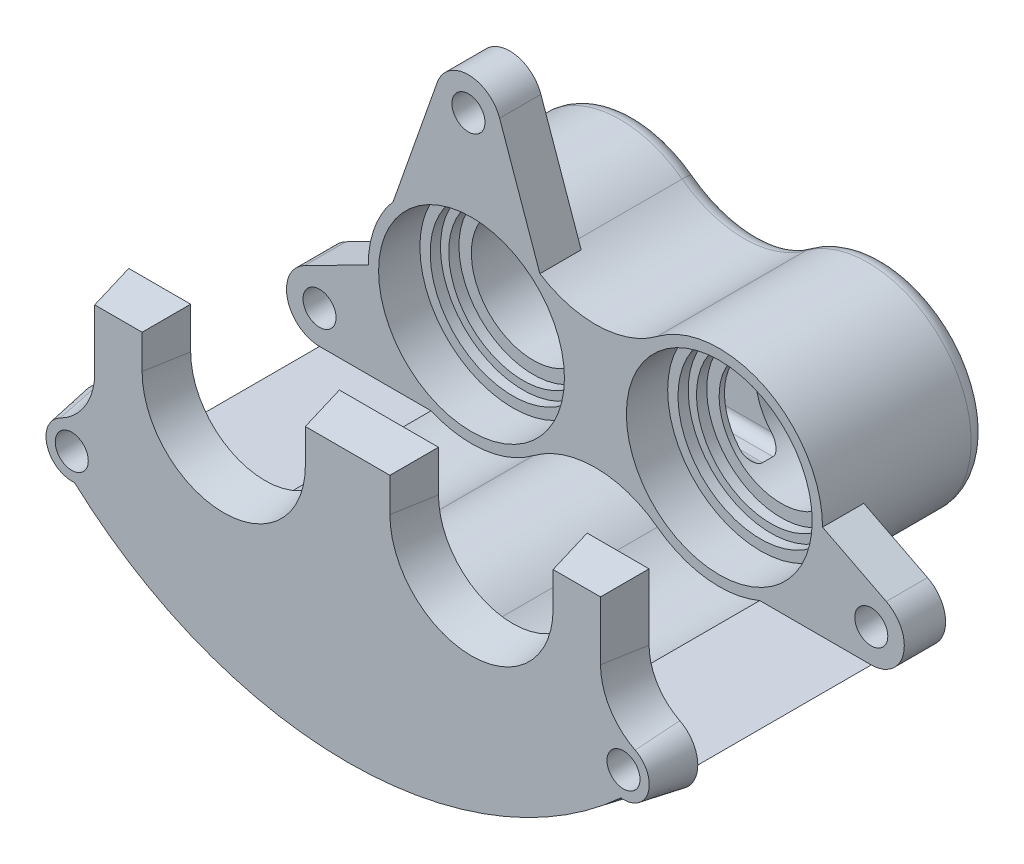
ISO-10303-21;
HEADER;
FILE_DESCRIPTION(('STEP AP214'),'2;1');
FILE_NAME('part.step','',(''),(''),'','','');
FILE_SCHEMA(('AUTOMOTIVE_DESIGN { 1 0 10303 214 1 1 1 1 }'));
ENDSEC;
DATA;
#1=APPLICATION_CONTEXT('core data for automotive mechanical design processes');
#2=APPLICATION_PROTOCOL_DEFINITION('international standard','automotive_design',2000,#1);
#3=PRODUCT_CONTEXT('',#1,'mechanical');
#4=PRODUCT('Part','Part','',(#3));
#5=PRODUCT_RELATED_PRODUCT_CATEGORY('part','',(#4));
#6=PRODUCT_DEFINITION_FORMATION('','',#4);
#7=PRODUCT_DEFINITION_CONTEXT('part definition',#1,'design');
#8=PRODUCT_DEFINITION('design','',#6,#7);
#9=PRODUCT_DEFINITION_SHAPE('','',#8);
#10=(LENGTH_UNIT() NAMED_UNIT(*) SI_UNIT(.MILLI.,.METRE.));
#11=(NAMED_UNIT(*) PLANE_ANGLE_UNIT() SI_UNIT($,.RADIAN.));
#12=(NAMED_UNIT(*) SI_UNIT($,.STERADIAN.) SOLID_ANGLE_UNIT());
#13=UNCERTAINTY_MEASURE_WITH_UNIT(LENGTH_MEASURE(1.E-05),#10,'distance_accuracy_value','');
#14=(GEOMETRIC_REPRESENTATION_CONTEXT(3) GLOBAL_UNCERTAINTY_ASSIGNED_CONTEXT((#13)) GLOBAL_UNIT_ASSIGNED_CONTEXT((#10,
#11,#12)) REPRESENTATION_CONTEXT('',''));
#15=CARTESIAN_POINT('',(0.,0.,0.));
#16=DIRECTION('',(0.,0.,1.));
#17=DIRECTION('',(1.,0.,0.));
#18=AXIS2_PLACEMENT_3D('',#15,#16,#17);
#19=CARTESIAN_POINT('',(9.525,12.7,12.7));
#20=DIRECTION('',(0.,0.,1.));
#21=DIRECTION('',(1.,0.,0.));
#22=AXIS2_PLACEMENT_3D('',#19,#20,#21);
#23=PLANE('',#22);
#24=CARTESIAN_POINT('',(-19.52244,27.94,12.7));
#25=DIRECTION('',(0.,0.,1.));
#26=DIRECTION('',(1.,0.,0.));
#27=AXIS2_PLACEMENT_3D('',#24,#25,#26);
#28=CIRCLE('',#27,2.54);
#29=CARTESIAN_POINT('',(-16.98244,27.94,12.7));
#30=VERTEX_POINT('',#29);
#31=EDGE_CURVE('E377',#30,#30,#28,.T.);
#32=ORIENTED_EDGE('',*,*,#31,.F.);
#33=EDGE_LOOP('',(#32));
#34=FACE_BOUND('',#33,.T.);
#35=CARTESIAN_POINT('',(19.05,0.,12.7));
#36=DIRECTION('',(0.,0.,-1.));
#37=DIRECTION('',(0.,1.,0.));
#38=AXIS2_PLACEMENT_3D('',#35,#36,#37);
#39=CIRCLE('',#38,14.2875);
#40=CARTESIAN_POINT('',(19.05,14.2875,12.7));
#41=VERTEX_POINT('',#40);
#42=EDGE_CURVE('E722',#41,#41,#39,.T.);
#43=ORIENTED_EDGE('',*,*,#42,.T.);
#44=EDGE_LOOP('',(#43));
#45=FACE_BOUND('',#44,.T.);
#46=CARTESIAN_POINT('',(-19.05,0.,12.7));
#47=DIRECTION('',(0.,0.,1.));
#48=DIRECTION('',(0.,1.,0.));
#49=AXIS2_PLACEMENT_3D('',#46,#47,#48);
#50=CIRCLE('',#49,14.2875);
#51=CARTESIAN_POINT('',(-19.05,14.2875,12.7));
#52=VERTEX_POINT('',#51);
#53=EDGE_CURVE('E752',#52,#52,#50,.T.);
#54=ORIENTED_EDGE('',*,*,#53,.F.);
#55=EDGE_LOOP('',(#54));
#56=FACE_BOUND('',#55,.T.);
#57=CARTESIAN_POINT('',(0.,25.4,12.7));
#58=DIRECTION('',(0.,0.,-1.));
#59=DIRECTION('',(1.,0.,0.));
#60=AXIS2_PLACEMENT_3D('',#57,#58,#59);
#61=CIRCLE('',#60,15.875);
#62=CARTESIAN_POINT('',(9.525,12.7,12.7));
#63=VERTEX_POINT('',#62);
#64=CARTESIAN_POINT('',(-8.53765634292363,12.0162767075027,12.7));
#65=VERTEX_POINT('',#64);
#66=EDGE_CURVE('E719',#63,#65,#61,.T.);
#67=ORIENTED_EDGE('',*,*,#66,.T.);
#68=DIRECTION('',(-0.331749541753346,0.943367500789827,0.));
#69=VECTOR('',#68,1.);
#70=CARTESIAN_POINT('',(-14.7301330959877,29.625287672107,12.7));
#71=LINE('',#70,#69);
#72=CARTESIAN_POINT('',(-14.7301330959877,29.625287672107,12.7));
#73=VERTEX_POINT('',#72);
#74=EDGE_CURVE('E391',#65,#73,#71,.T.);
#75=ORIENTED_EDGE('',*,*,#74,.T.);
#76=CARTESIAN_POINT('',(-19.52244,27.94,12.7));
#77=DIRECTION('',(0.,0.,1.));
#78=DIRECTION('',(-1.,0.,0.));
#79=AXIS2_PLACEMENT_3D('',#76,#77,#78);
#80=CIRCLE('',#79,5.08);
#81=CARTESIAN_POINT('',(-24.3147469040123,29.625287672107,12.7));
#82=VERTEX_POINT('',#81);
#83=EDGE_CURVE('E408',#73,#82,#80,.T.);
#84=ORIENTED_EDGE('',*,*,#83,.T.);
#85=DIRECTION('',(-0.331749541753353,-0.943367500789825,0.));
#86=VECTOR('',#85,1.);
#87=CARTESIAN_POINT('',(-31.097381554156,10.3380956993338,12.7));
#88=LINE('',#87,#86);
#89=CARTESIAN_POINT('',(-31.097381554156,10.3380956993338,12.7));
#90=VERTEX_POINT('',#89);
#91=EDGE_CURVE('E398',#82,#90,#88,.T.);
#92=ORIENTED_EDGE('',*,*,#91,.T.);
#93=CARTESIAN_POINT('',(-19.05,0.,12.7));
#94=DIRECTION('',(0.,0.,1.));
#95=DIRECTION('',(1.,0.,0.));
#96=AXIS2_PLACEMENT_3D('',#93,#94,#95);
#97=CIRCLE('',#96,15.875);
#98=CARTESIAN_POINT('',(-34.9249989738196,-0.0057079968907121,12.7));
#99=VERTEX_POINT('',#98);
#100=EDGE_CURVE('E716',#90,#99,#97,.T.);
#101=ORIENTED_EDGE('',*,*,#100,.T.);
#102=DIRECTION('',(-0.891006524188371,-0.453990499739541,0.));
#103=VECTOR('',#102,1.);
#104=CARTESIAN_POINT('',(-44.7242717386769,-4.99868685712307,12.7));
#105=LINE('',#104,#103);
#106=CARTESIAN_POINT('',(-44.7242717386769,-4.99868685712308,12.7));
#107=VERTEX_POINT('',#106);
#108=EDGE_CURVE('E443',#99,#107,#105,.T.);
#109=ORIENTED_EDGE('',*,*,#108,.T.);
#110=CARTESIAN_POINT('',(-42.418,-9.525,12.7));
#111=DIRECTION('',(0.,0.,1.));
#112=DIRECTION('',(-1.,0.,0.));
#113=AXIS2_PLACEMENT_3D('',#110,#111,#112);
#114=CIRCLE('',#113,5.08);
#115=CARTESIAN_POINT('',(-42.418,-14.605,12.7));
#116=VERTEX_POINT('',#115);
#117=EDGE_CURVE('E460',#107,#116,#114,.T.);
#118=ORIENTED_EDGE('',*,*,#117,.T.);
#119=DIRECTION('',(1.,0.,0.));
#120=VECTOR('',#119,1.);
#121=CARTESIAN_POINT('',(-25.2717039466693,-14.605,12.7));
#122=LINE('',#121,#120);
#123=CARTESIAN_POINT('',(-25.2717039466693,-14.605,12.7));
#124=VERTEX_POINT('',#123);
#125=EDGE_CURVE('E356',#116,#124,#122,.T.);
#126=ORIENTED_EDGE('',*,*,#125,.T.);
#127=CARTESIAN_POINT('',(-9.525,-12.7,12.7));
#128=VERTEX_POINT('',#127);
#129=EDGE_CURVE('E718',#124,#128,#97,.T.);
#130=ORIENTED_EDGE('',*,*,#129,.T.);
#131=CARTESIAN_POINT('',(0.,-25.4,12.7));
#132=DIRECTION('',(0.,0.,-1.));
#133=DIRECTION('',(-1.,0.,0.));
#134=AXIS2_PLACEMENT_3D('',#131,#132,#133);
#135=CIRCLE('',#134,15.875);
#136=CARTESIAN_POINT('',(9.525,-12.7,12.7));
#137=VERTEX_POINT('',#136);
#138=EDGE_CURVE('E713',#128,#137,#135,.T.);
#139=ORIENTED_EDGE('',*,*,#138,.T.);
#140=CARTESIAN_POINT('',(19.05,0.,12.7));
#141=DIRECTION('',(0.,0.,1.));
#142=DIRECTION('',(-1.,0.,0.));
#143=AXIS2_PLACEMENT_3D('',#140,#141,#142);
#144=CIRCLE('',#143,15.875);
#145=CARTESIAN_POINT('',(25.2717039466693,-14.605,12.7));
#146=VERTEX_POINT('',#145);
#147=EDGE_CURVE('E709',#137,#146,#144,.T.);
#148=ORIENTED_EDGE('',*,*,#147,.T.);
#149=DIRECTION('',(-1.,0.,0.));
#150=VECTOR('',#149,1.);
#151=CARTESIAN_POINT('',(25.2717039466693,-14.605,12.7));
#152=LINE('',#151,#150);
#153=CARTESIAN_POINT('',(42.418,-14.605,12.7));
#154=VERTEX_POINT('',#153);
#155=EDGE_CURVE('E425',#154,#146,#152,.T.);
#156=ORIENTED_EDGE('',*,*,#155,.F.);
#157=CARTESIAN_POINT('',(42.418,-9.525,12.7));
#158=DIRECTION('',(0.,0.,-1.));
#159=DIRECTION('',(1.,0.,0.));
#160=AXIS2_PLACEMENT_3D('',#157,#158,#159);
#161=CIRCLE('',#160,5.08);
#162=CARTESIAN_POINT('',(44.7242717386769,-4.99868685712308,12.7));
#163=VERTEX_POINT('',#162);
#164=EDGE_CURVE('E437',#163,#154,#161,.T.);
#165=ORIENTED_EDGE('',*,*,#164,.F.);
#166=DIRECTION('',(0.891006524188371,-0.453990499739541,0.));
#167=VECTOR('',#166,1.);
#168=CARTESIAN_POINT('',(44.7242717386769,-4.99868685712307,12.7));
#169=LINE('',#168,#167);
#170=CARTESIAN_POINT('',(34.9249989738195,-0.0057079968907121,12.7));
#171=VERTEX_POINT('',#170);
#172=EDGE_CURVE('E430',#171,#163,#169,.T.);
#173=ORIENTED_EDGE('',*,*,#172,.F.);
#174=EDGE_CURVE('E712',#171,#63,#144,.T.);
#175=ORIENTED_EDGE('',*,*,#174,.T.);
#176=EDGE_LOOP('',(#67,#75,#84,#92,#101,#109,#118,#126,#130,#139,#148,#156,#165,#173,#175));
#177=FACE_BOUND('',#176,.T.);
#178=CARTESIAN_POINT('',(42.418,-9.525,12.7));
#179=DIRECTION('',(0.,0.,1.));
#180=DIRECTION('',(1.,0.,0.));
#181=AXIS2_PLACEMENT_3D('',#178,#179,#180);
#182=CIRCLE('',#181,2.54);
#183=CARTESIAN_POINT('',(44.958,-9.525,12.7));
#184=VERTEX_POINT('',#183);
#185=EDGE_CURVE('E350',#184,#184,#182,.T.);
#186=ORIENTED_EDGE('',*,*,#185,.F.);
#187=EDGE_LOOP('',(#186));
#188=FACE_BOUND('',#187,.T.);
#189=CARTESIAN_POINT('',(-42.418,-9.525,12.7));
#190=DIRECTION('',(0.,0.,1.));
#191=DIRECTION('',(1.,0.,0.));
#192=AXIS2_PLACEMENT_3D('',#189,#190,#191);
#193=CIRCLE('',#192,2.54);
#194=CARTESIAN_POINT('',(-39.878,-9.525,12.7));
#195=VERTEX_POINT('',#194);
#196=EDGE_CURVE('E918',#195,#195,#193,.F.);
#197=ORIENTED_EDGE('',*,*,#196,.T.);
#198=EDGE_LOOP('',(#197));
#199=FACE_BOUND('',#198,.T.);
#200=ADVANCED_FACE('F32',(#34,#45,#56,#177,#188,#199),#23,.T.);
#201=CARTESIAN_POINT('',(-19.05,0.,6.35));
#202=DIRECTION('',(0.,0.,-1.));
#203=DIRECTION('',(-1.,0.,0.));
#204=AXIS2_PLACEMENT_3D('',#201,#202,#203);
#205=PLANE('',#204);
#206=CARTESIAN_POINT('',(-19.05,0.,6.35));
#207=DIRECTION('',(0.,0.,-1.));
#208=DIRECTION('',(-1.,0.,0.));
#209=AXIS2_PLACEMENT_3D('',#206,#207,#208);
#210=CIRCLE('',#209,15.875);
#211=CARTESIAN_POINT('',(-9.525,-12.7,6.35));
#212=VERTEX_POINT('',#211);
#213=CARTESIAN_POINT('',(-34.9249989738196,-0.0057079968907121,6.35));
#214=VERTEX_POINT('',#213);
#215=EDGE_CURVE('E448',#212,#214,#210,.T.);
#216=ORIENTED_EDGE('',*,*,#215,.F.);
#217=CARTESIAN_POINT('',(0.,-25.4,6.35));
#218=DIRECTION('',(0.,0.,-1.));
#219=DIRECTION('',(-1.,0.,0.));
#220=AXIS2_PLACEMENT_3D('',#217,#218,#219);
#221=CIRCLE('',#220,15.875);
#222=CARTESIAN_POINT('',(9.525,-12.7,6.35));
#223=VERTEX_POINT('',#222);
#224=EDGE_CURVE('E342',#212,#223,#221,.T.);
#225=ORIENTED_EDGE('',*,*,#224,.T.);
#226=CARTESIAN_POINT('',(19.05,0.,6.35));
#227=DIRECTION('',(0.,0.,1.));
#228=DIRECTION('',(1.,0.,0.));
#229=AXIS2_PLACEMENT_3D('',#226,#227,#228);
#230=CIRCLE('',#229,15.875);
#231=CARTESIAN_POINT('',(34.9249989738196,-0.0057079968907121,6.35));
#232=VERTEX_POINT('',#231);
#233=EDGE_CURVE('E426',#223,#232,#230,.T.);
#234=ORIENTED_EDGE('',*,*,#233,.T.);
#235=DIRECTION('',(0.891006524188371,-0.453990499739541,0.));
#236=VECTOR('',#235,1.);
#237=CARTESIAN_POINT('',(44.7242717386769,-4.99868685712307,6.35));
#238=LINE('',#237,#236);
#239=CARTESIAN_POINT('',(44.7242717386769,-4.99868685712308,6.35));
#240=VERTEX_POINT('',#239);
#241=EDGE_CURVE('E433',#232,#240,#238,.T.);
#242=ORIENTED_EDGE('',*,*,#241,.T.);
#243=CARTESIAN_POINT('',(42.418,-9.525,6.35));
#244=DIRECTION('',(0.,0.,-1.));
#245=DIRECTION('',(1.,0.,0.));
#246=AXIS2_PLACEMENT_3D('',#243,#244,#245);
#247=CIRCLE('',#246,5.08);
#248=CARTESIAN_POINT('',(42.418,-14.605,6.35));
#249=VERTEX_POINT('',#248);
#250=EDGE_CURVE('E429',#240,#249,#247,.T.);
#251=ORIENTED_EDGE('',*,*,#250,.T.);
#252=CARTESIAN_POINT('',(0.,32.6492408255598,6.35));
#253=DIRECTION('',(0.,0.,-1.));
#254=DIRECTION('',(-1.,0.,0.));
#255=AXIS2_PLACEMENT_3D('',#252,#253,#254);
#256=CIRCLE('',#255,63.5);
#257=CARTESIAN_POINT('',(-42.418,-14.605,6.35));
#258=VERTEX_POINT('',#257);
#259=EDGE_CURVE('E374',#249,#258,#256,.T.);
#260=ORIENTED_EDGE('',*,*,#259,.T.);
#261=CARTESIAN_POINT('',(-42.418,-9.525,6.35));
#262=DIRECTION('',(0.,0.,1.));
#263=DIRECTION('',(-1.,0.,0.));
#264=AXIS2_PLACEMENT_3D('',#261,#262,#263);
#265=CIRCLE('',#264,5.08);
#266=CARTESIAN_POINT('',(-44.7242717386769,-4.99868685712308,6.35));
#267=VERTEX_POINT('',#266);
#268=EDGE_CURVE('E454',#267,#258,#265,.T.);
#269=ORIENTED_EDGE('',*,*,#268,.F.);
#270=DIRECTION('',(-0.891006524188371,-0.453990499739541,0.));
#271=VECTOR('',#270,1.);
#272=CARTESIAN_POINT('',(-44.7242717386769,-4.99868685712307,6.35));
#273=LINE('',#272,#271);
#274=EDGE_CURVE('E451',#214,#267,#273,.T.);
#275=ORIENTED_EDGE('',*,*,#274,.F.);
#276=EDGE_LOOP('',(#216,#225,#234,#242,#251,#260,#269,#275));
#277=FACE_BOUND('',#276,.T.);
#278=CARTESIAN_POINT('',(42.418,-9.525,6.35));
#279=DIRECTION('',(0.,0.,-1.));
#280=DIRECTION('',(-1.,0.,0.));
#281=AXIS2_PLACEMENT_3D('',#278,#279,#280);
#282=CIRCLE('',#281,2.54);
#283=CARTESIAN_POINT('',(39.878,-9.525,6.35));
#284=VERTEX_POINT('',#283);
#285=EDGE_CURVE('E699',#284,#284,#282,.T.);
#286=ORIENTED_EDGE('',*,*,#285,.F.);
#287=EDGE_LOOP('',(#286));
#288=FACE_BOUND('',#287,.T.);
#289=CARTESIAN_POINT('',(-42.418,-9.525,6.35));
#290=DIRECTION('',(0.,0.,-1.));
#291=DIRECTION('',(-1.,0.,0.));
#292=AXIS2_PLACEMENT_3D('',#289,#290,#291);
#293=CIRCLE('',#292,2.54);
#294=CARTESIAN_POINT('',(-44.958,-9.525,6.35));
#295=VERTEX_POINT('',#294);
#296=EDGE_CURVE('E695',#295,#295,#293,.F.);
#297=ORIENTED_EDGE('',*,*,#296,.T.);
#298=EDGE_LOOP('',(#297));
#299=FACE_BOUND('',#298,.T.);
#300=ADVANCED_FACE('F610',(#277,#288,#299),#205,.T.);
#301=CARTESIAN_POINT('',(-42.418,-9.525,50.8));
#302=DIRECTION('',(0.,0.,1.));
#303=DIRECTION('',(1.,0.,0.));
#304=AXIS2_PLACEMENT_3D('',#301,#302,#303);
#305=PLANE('',#304);
#306=CARTESIAN_POINT('',(-42.418,-9.525,50.8));
#307=DIRECTION('',(0.,0.,1.));
#308=DIRECTION('',(1.,0.,0.));
#309=AXIS2_PLACEMENT_3D('',#306,#307,#308);
#310=CIRCLE('',#309,3.96032367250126);
#311=CARTESIAN_POINT('',(-44.2159493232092,-5.99632576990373,50.8));
#312=VERTEX_POINT('',#311);
#313=CARTESIAN_POINT('',(-42.0101126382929,-13.46426281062,50.8));
#314=VERTEX_POINT('',#313);
#315=EDGE_CURVE('E955',#312,#314,#310,.T.);
#316=ORIENTED_EDGE('',*,*,#315,.T.);
#317=CARTESIAN_POINT('',(0.,32.6492408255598,50.8));
#318=DIRECTION('',(0.,0.,1.));
#319=DIRECTION('',(1.,0.,0.));
#320=AXIS2_PLACEMENT_3D('',#317,#318,#319);
#321=CIRCLE('',#320,62.3803236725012);
#322=CARTESIAN_POINT('',(42.0101126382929,-13.46426281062,50.8));
#323=VERTEX_POINT('',#322);
#324=EDGE_CURVE('E338',#314,#323,#321,.T.);
#325=ORIENTED_EDGE('',*,*,#324,.T.);
#326=CARTESIAN_POINT('',(42.418,-9.525,50.8));
#327=DIRECTION('',(0.,0.,1.));
#328=DIRECTION('',(1.,0.,0.));
#329=AXIS2_PLACEMENT_3D('',#326,#327,#328);
#330=CIRCLE('',#329,3.96032367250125);
#331=CARTESIAN_POINT('',(44.2159493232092,-5.99632576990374,50.8));
#332=VERTEX_POINT('',#331);
#333=EDGE_CURVE('E982',#323,#332,#330,.T.);
#334=ORIENTED_EDGE('',*,*,#333,.T.);
#335=CARTESIAN_POINT('',(48.6482044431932,2.70246469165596,50.8));
#336=DIRECTION('',(0.,0.,1.));
#337=DIRECTION('',(1.,0.,0.));
#338=AXIS2_PLACEMENT_3D('',#335,#336,#337);
#339=CIRCLE('',#338,9.76288077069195);
#340=CARTESIAN_POINT('',(38.8853236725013,2.70246469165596,50.8));
#341=VERTEX_POINT('',#340);
#342=EDGE_CURVE('E984',#332,#341,#339,.F.);
#343=ORIENTED_EDGE('',*,*,#342,.T.);
#344=DIRECTION('',(0.,-1.,0.));
#345=VECTOR('',#344,1.);
#346=CARTESIAN_POINT('',(38.8853236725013,12.862464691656,50.8));
#347=LINE('',#346,#345);
#348=CARTESIAN_POINT('',(38.8853236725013,11.7427883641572,50.8));
#349=VERTEX_POINT('',#348);
#350=EDGE_CURVE('E986',#341,#349,#347,.F.);
#351=ORIENTED_EDGE('',*,*,#350,.T.);
#352=DIRECTION('',(1.,0.,0.));
#353=VECTOR('',#352,1.);
#354=CARTESIAN_POINT('',(30.48,11.7427883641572,50.8));
#355=LINE('',#354,#353);
#356=CARTESIAN_POINT('',(31.5996763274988,11.7427883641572,50.8));
#357=VERTEX_POINT('',#356);
#358=EDGE_CURVE('E988',#349,#357,#355,.F.);
#359=ORIENTED_EDGE('',*,*,#358,.T.);
#360=DIRECTION('',(0.,1.,0.));
#361=VECTOR('',#360,1.);
#362=CARTESIAN_POINT('',(31.5996763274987,6.51246469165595,50.8));
#363=LINE('',#362,#361);
#364=CARTESIAN_POINT('',(31.5996763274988,6.51246469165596,50.8));
#365=VERTEX_POINT('',#364);
#366=EDGE_CURVE('E990',#357,#365,#363,.F.);
#367=ORIENTED_EDGE('',*,*,#366,.T.);
#368=CARTESIAN_POINT('',(19.05,6.51246469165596,50.8));
#369=DIRECTION('',(0.,0.,1.));
#370=DIRECTION('',(1.,0.,0.));
#371=AXIS2_PLACEMENT_3D('',#368,#369,#370);
#372=CIRCLE('',#371,12.5496763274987);
#373=CARTESIAN_POINT('',(6.50032367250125,6.51246469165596,50.8));
#374=VERTEX_POINT('',#373);
#375=EDGE_CURVE('E992',#365,#374,#372,.F.);
#376=ORIENTED_EDGE('',*,*,#375,.T.);
#377=DIRECTION('',(0.,-1.,0.));
#378=VECTOR('',#377,1.);
#379=CARTESIAN_POINT('',(6.50032367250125,12.862464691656,50.8));
#380=LINE('',#379,#378);
#381=CARTESIAN_POINT('',(6.50032367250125,11.7427883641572,50.8));
#382=VERTEX_POINT('',#381);
#383=EDGE_CURVE('E994',#374,#382,#380,.F.);
#384=ORIENTED_EDGE('',*,*,#383,.T.);
#385=DIRECTION('',(1.,0.,0.));
#386=VECTOR('',#385,1.);
#387=CARTESIAN_POINT('',(-7.62,11.7427883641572,50.8));
#388=LINE('',#387,#386);
#389=CARTESIAN_POINT('',(-6.50032367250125,11.7427883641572,50.8));
#390=VERTEX_POINT('',#389);
#391=EDGE_CURVE('E996',#382,#390,#388,.F.);
#392=ORIENTED_EDGE('',*,*,#391,.T.);
#393=DIRECTION('',(0.,1.,0.));
#394=VECTOR('',#393,1.);
#395=CARTESIAN_POINT('',(-6.50032367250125,6.51246469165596,50.8));
#396=LINE('',#395,#394);
#397=CARTESIAN_POINT('',(-6.50032367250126,6.51246469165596,50.8));
#398=VERTEX_POINT('',#397);
#399=EDGE_CURVE('E998',#390,#398,#396,.F.);
#400=ORIENTED_EDGE('',*,*,#399,.T.);
#401=CARTESIAN_POINT('',(-19.05,6.51246469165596,50.8));
#402=DIRECTION('',(0.,0.,1.));
#403=DIRECTION('',(1.,0.,0.));
#404=AXIS2_PLACEMENT_3D('',#401,#402,#403);
#405=CIRCLE('',#404,12.5496763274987);
#406=CARTESIAN_POINT('',(-31.5996763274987,6.51246469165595,50.8));
#407=VERTEX_POINT('',#406);
#408=EDGE_CURVE('E1000',#398,#407,#405,.F.);
#409=ORIENTED_EDGE('',*,*,#408,.T.);
#410=DIRECTION('',(0.,-1.,0.));
#411=VECTOR('',#410,1.);
#412=CARTESIAN_POINT('',(-31.5996763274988,12.862464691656,50.8));
#413=LINE('',#412,#411);
#414=CARTESIAN_POINT('',(-31.5996763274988,11.7427883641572,50.8));
#415=VERTEX_POINT('',#414);
#416=EDGE_CURVE('E1002',#407,#415,#413,.F.);
#417=ORIENTED_EDGE('',*,*,#416,.T.);
#418=DIRECTION('',(1.,0.,0.));
#419=VECTOR('',#418,1.);
#420=CARTESIAN_POINT('',(-40.005,11.7427883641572,50.8));
#421=LINE('',#420,#419);
#422=CARTESIAN_POINT('',(-38.8853236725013,11.7427883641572,50.8));
#423=VERTEX_POINT('',#422);
#424=EDGE_CURVE('E1004',#415,#423,#421,.F.);
#425=ORIENTED_EDGE('',*,*,#424,.T.);
#426=DIRECTION('',(0.,1.,0.));
#427=VECTOR('',#426,1.);
#428=CARTESIAN_POINT('',(-38.8853236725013,2.70246469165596,50.8));
#429=LINE('',#428,#427);
#430=CARTESIAN_POINT('',(-38.8853236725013,2.70246469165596,50.8));
#431=VERTEX_POINT('',#430);
#432=EDGE_CURVE('E1006',#423,#431,#429,.F.);
#433=ORIENTED_EDGE('',*,*,#432,.T.);
#434=CARTESIAN_POINT('',(-48.6482044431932,2.70246469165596,50.8));
#435=DIRECTION('',(0.,0.,1.));
#436=DIRECTION('',(1.,0.,0.));
#437=AXIS2_PLACEMENT_3D('',#434,#435,#436);
#438=CIRCLE('',#437,9.76288077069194);
#439=EDGE_CURVE('E1008',#431,#312,#438,.F.);
#440=ORIENTED_EDGE('',*,*,#439,.T.);
#441=EDGE_LOOP('',(#316,#325,#334,#343,#351,#359,#367,#376,#384,#392,#400,#409,#417,#425,#433,#440));
#442=FACE_BOUND('',#441,.T.);
#443=CARTESIAN_POINT('',(42.418,-9.525,50.8));
#444=DIRECTION('',(0.,0.,1.));
#445=DIRECTION('',(1.,0.,0.));
#446=AXIS2_PLACEMENT_3D('',#443,#444,#445);
#447=CIRCLE('',#446,2.54);
#448=CARTESIAN_POINT('',(44.958,-9.525,50.8));
#449=VERTEX_POINT('',#448);
#450=EDGE_CURVE('E700',#449,#449,#447,.T.);
#451=ORIENTED_EDGE('',*,*,#450,.F.);
#452=EDGE_LOOP('',(#451));
#453=FACE_BOUND('',#452,.T.);
#454=CARTESIAN_POINT('',(-42.418,-9.525,50.8));
#455=DIRECTION('',(0.,0.,-1.));
#456=DIRECTION('',(-1.,0.,0.));
#457=AXIS2_PLACEMENT_3D('',#454,#455,#456);
#458=CIRCLE('',#457,2.54);
#459=CARTESIAN_POINT('',(-44.958,-9.525,50.8));
#460=VERTEX_POINT('',#459);
#461=EDGE_CURVE('E667',#460,#460,#458,.T.);
#462=ORIENTED_EDGE('',*,*,#461,.T.);
#463=EDGE_LOOP('',(#462));
#464=FACE_BOUND('',#463,.T.);
#465=ADVANCED_FACE('F616',(#442,#453,#464),#305,.T.);
#466=CARTESIAN_POINT('',(-42.418,-9.525,44.45));
#467=DIRECTION('',(0.,0.,1.));
#468=DIRECTION('',(1.,0.,0.));
#469=AXIS2_PLACEMENT_3D('',#466,#467,#468);
#470=PLANE('',#469);
#471=DIRECTION('',(1.,0.,0.));
#472=VECTOR('',#471,1.);
#473=CARTESIAN_POINT('',(-42.418,-14.605,44.45));
#474=LINE('',#473,#472);
#475=CARTESIAN_POINT('',(-42.418,-14.605,44.45));
#476=VERTEX_POINT('',#475);
#477=CARTESIAN_POINT('',(-25.2717039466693,-14.605,44.45));
#478=VERTEX_POINT('',#477);
#479=EDGE_CURVE('E315',#476,#478,#474,.T.);
#480=ORIENTED_EDGE('',*,*,#479,.F.);
#481=CARTESIAN_POINT('',(-42.418,-9.525,44.45));
#482=DIRECTION('',(0.,0.,1.));
#483=DIRECTION('',(1.,0.,0.));
#484=AXIS2_PLACEMENT_3D('',#481,#482,#483);
#485=CIRCLE('',#484,5.08000000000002);
#486=CARTESIAN_POINT('',(-44.7242717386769,-4.99868685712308,44.45));
#487=VERTEX_POINT('',#486);
#488=EDGE_CURVE('E321',#487,#476,#485,.T.);
#489=ORIENTED_EDGE('',*,*,#488,.F.);
#490=CARTESIAN_POINT('',(-48.6482044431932,2.70246469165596,44.45));
#491=DIRECTION('',(0.,0.,-1.));
#492=DIRECTION('',(1.,0.,0.));
#493=AXIS2_PLACEMENT_3D('',#490,#491,#492);
#494=CIRCLE('',#493,8.64320444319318);
#495=CARTESIAN_POINT('',(-40.005,2.70246469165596,44.45));
#496=VERTEX_POINT('',#495);
#497=EDGE_CURVE('E954',#496,#487,#494,.T.);
#498=ORIENTED_EDGE('',*,*,#497,.F.);
#499=DIRECTION('',(0.,-1.,0.));
#500=VECTOR('',#499,1.);
#501=CARTESIAN_POINT('',(-40.005,2.70246469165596,44.45));
#502=LINE('',#501,#500);
#503=CARTESIAN_POINT('',(-40.005,12.862464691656,44.45));
#504=VERTEX_POINT('',#503);
#505=EDGE_CURVE('E952',#504,#496,#502,.T.);
#506=ORIENTED_EDGE('',*,*,#505,.F.);
#507=DIRECTION('',(-1.,0.,0.));
#508=VECTOR('',#507,1.);
#509=CARTESIAN_POINT('',(-40.005,12.862464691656,44.45));
#510=LINE('',#509,#508);
#511=CARTESIAN_POINT('',(-30.48,12.862464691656,44.45));
#512=VERTEX_POINT('',#511);
#513=EDGE_CURVE('E950',#512,#504,#510,.T.);
#514=ORIENTED_EDGE('',*,*,#513,.F.);
#515=DIRECTION('',(0.,1.,0.));
#516=VECTOR('',#515,1.);
#517=CARTESIAN_POINT('',(-30.48,12.862464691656,44.45));
#518=LINE('',#517,#516);
#519=CARTESIAN_POINT('',(-30.48,6.51246469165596,44.45));
#520=VERTEX_POINT('',#519);
#521=EDGE_CURVE('E948',#520,#512,#518,.T.);
#522=ORIENTED_EDGE('',*,*,#521,.F.);
#523=CARTESIAN_POINT('',(-19.05,6.51246469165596,44.45));
#524=DIRECTION('',(0.,0.,-1.));
#525=DIRECTION('',(1.,0.,0.));
#526=AXIS2_PLACEMENT_3D('',#523,#524,#525);
#527=CIRCLE('',#526,11.43);
#528=CARTESIAN_POINT('',(-7.62,6.51246469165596,44.45));
#529=VERTEX_POINT('',#528);
#530=EDGE_CURVE('E946',#529,#520,#527,.T.);
#531=ORIENTED_EDGE('',*,*,#530,.F.);
#532=DIRECTION('',(0.,-1.,0.));
#533=VECTOR('',#532,1.);
#534=CARTESIAN_POINT('',(-7.62,6.51246469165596,44.45));
#535=LINE('',#534,#533);
#536=CARTESIAN_POINT('',(-7.62,12.862464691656,44.45));
#537=VERTEX_POINT('',#536);
#538=EDGE_CURVE('E944',#537,#529,#535,.T.);
#539=ORIENTED_EDGE('',*,*,#538,.F.);
#540=DIRECTION('',(-1.,0.,0.));
#541=VECTOR('',#540,1.);
#542=CARTESIAN_POINT('',(-7.62,12.862464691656,44.45));
#543=LINE('',#542,#541);
#544=CARTESIAN_POINT('',(7.62,12.862464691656,44.45));
#545=VERTEX_POINT('',#544);
#546=EDGE_CURVE('E942',#545,#537,#543,.T.);
#547=ORIENTED_EDGE('',*,*,#546,.F.);
#548=DIRECTION('',(0.,1.,0.));
#549=VECTOR('',#548,1.);
#550=CARTESIAN_POINT('',(7.62,12.862464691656,44.45));
#551=LINE('',#550,#549);
#552=CARTESIAN_POINT('',(7.62000000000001,6.51246469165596,44.45));
#553=VERTEX_POINT('',#552);
#554=EDGE_CURVE('E940',#553,#545,#551,.T.);
#555=ORIENTED_EDGE('',*,*,#554,.F.);
#556=CARTESIAN_POINT('',(19.05,6.51246469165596,44.45));
#557=DIRECTION('',(0.,0.,-1.));
#558=DIRECTION('',(1.,0.,0.));
#559=AXIS2_PLACEMENT_3D('',#556,#557,#558);
#560=CIRCLE('',#559,11.43);
#561=CARTESIAN_POINT('',(30.48,6.51246469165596,44.45));
#562=VERTEX_POINT('',#561);
#563=EDGE_CURVE('E938',#562,#553,#560,.T.);
#564=ORIENTED_EDGE('',*,*,#563,.F.);
#565=DIRECTION('',(0.,-1.,0.));
#566=VECTOR('',#565,1.);
#567=CARTESIAN_POINT('',(30.48,6.51246469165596,44.45));
#568=LINE('',#567,#566);
#569=CARTESIAN_POINT('',(30.48,12.862464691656,44.45));
#570=VERTEX_POINT('',#569);
#571=EDGE_CURVE('E936',#570,#562,#568,.T.);
#572=ORIENTED_EDGE('',*,*,#571,.F.);
#573=DIRECTION('',(-1.,0.,0.));
#574=VECTOR('',#573,1.);
#575=CARTESIAN_POINT('',(30.48,12.862464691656,44.45));
#576=LINE('',#575,#574);
#577=CARTESIAN_POINT('',(40.005,12.862464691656,44.45));
#578=VERTEX_POINT('',#577);
#579=EDGE_CURVE('E934',#578,#570,#576,.T.);
#580=ORIENTED_EDGE('',*,*,#579,.F.);
#581=DIRECTION('',(0.,1.,0.));
#582=VECTOR('',#581,1.);
#583=CARTESIAN_POINT('',(40.005,12.862464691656,44.45));
#584=LINE('',#583,#582);
#585=CARTESIAN_POINT('',(40.005,2.70246469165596,44.45));
#586=VERTEX_POINT('',#585);
#587=EDGE_CURVE('E932',#586,#578,#584,.T.);
#588=ORIENTED_EDGE('',*,*,#587,.F.);
#589=CARTESIAN_POINT('',(48.6482044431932,2.70246469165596,44.45));
#590=DIRECTION('',(0.,0.,-1.));
#591=DIRECTION('',(1.,0.,0.));
#592=AXIS2_PLACEMENT_3D('',#589,#590,#591);
#593=CIRCLE('',#592,8.64320444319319);
#594=CARTESIAN_POINT('',(44.7242717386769,-4.99868685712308,44.45));
#595=VERTEX_POINT('',#594);
#596=EDGE_CURVE('E930',#595,#586,#593,.T.);
#597=ORIENTED_EDGE('',*,*,#596,.F.);
#598=CARTESIAN_POINT('',(42.418,-9.525,44.45));
#599=DIRECTION('',(0.,0.,1.));
#600=DIRECTION('',(1.,0.,0.));
#601=AXIS2_PLACEMENT_3D('',#598,#599,#600);
#602=CIRCLE('',#601,5.08);
#603=CARTESIAN_POINT('',(42.418,-14.605,44.45));
#604=VERTEX_POINT('',#603);
#605=EDGE_CURVE('E349',#604,#595,#602,.T.);
#606=ORIENTED_EDGE('',*,*,#605,.F.);
#607=DIRECTION('',(1.,0.,0.));
#608=VECTOR('',#607,1.);
#609=CARTESIAN_POINT('',(42.418,-14.605,44.45));
#610=LINE('',#609,#608);
#611=CARTESIAN_POINT('',(25.2717039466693,-14.605,44.45));
#612=VERTEX_POINT('',#611);
#613=EDGE_CURVE('E366',#612,#604,#610,.T.);
#614=ORIENTED_EDGE('',*,*,#613,.F.);
#615=CARTESIAN_POINT('',(19.05,0.,44.45));
#616=DIRECTION('',(0.,0.,1.));
#617=DIRECTION('',(-1.,0.,0.));
#618=AXIS2_PLACEMENT_3D('',#615,#616,#617);
#619=CIRCLE('',#618,15.875);
#620=CARTESIAN_POINT('',(9.525,-12.7,44.45));
#621=VERTEX_POINT('',#620);
#622=EDGE_CURVE('E368',#621,#612,#619,.T.);
#623=ORIENTED_EDGE('',*,*,#622,.F.);
#624=CARTESIAN_POINT('',(0.,-25.4,44.45));
#625=DIRECTION('',(0.,0.,-1.));
#626=DIRECTION('',(-1.,0.,0.));
#627=AXIS2_PLACEMENT_3D('',#624,#625,#626);
#628=CIRCLE('',#627,15.875);
#629=CARTESIAN_POINT('',(-9.525,-12.7,44.45));
#630=VERTEX_POINT('',#629);
#631=EDGE_CURVE('E1011',#630,#621,#628,.T.);
#632=ORIENTED_EDGE('',*,*,#631,.F.);
#633=CARTESIAN_POINT('',(-19.05,0.,44.45));
#634=DIRECTION('',(0.,0.,1.));
#635=DIRECTION('',(-1.,0.,0.));
#636=AXIS2_PLACEMENT_3D('',#633,#634,#635);
#637=CIRCLE('',#636,15.875);
#638=EDGE_CURVE('E323',#478,#630,#637,.T.);
#639=ORIENTED_EDGE('',*,*,#638,.F.);
#640=EDGE_LOOP('',(#480,#489,#498,#506,#514,#522,#531,#539,#547,#555,#564,#572,#580,#588,#597,
#606,#614,#623,#632,#639));
#641=FACE_BOUND('',#640,.T.);
#642=CARTESIAN_POINT('',(42.418,-9.525,44.45));
#643=DIRECTION('',(0.,0.,1.));
#644=DIRECTION('',(1.,0.,0.));
#645=AXIS2_PLACEMENT_3D('',#642,#643,#644);
#646=CIRCLE('',#645,2.54);
#647=CARTESIAN_POINT('',(44.958,-9.525,44.45));
#648=VERTEX_POINT('',#647);
#649=EDGE_CURVE('E696',#648,#648,#646,.T.);
#650=ORIENTED_EDGE('',*,*,#649,.T.);
#651=EDGE_LOOP('',(#650));
#652=FACE_BOUND('',#651,.T.);
#653=CARTESIAN_POINT('',(-42.418,-9.525,44.45));
#654=DIRECTION('',(0.,0.,1.));
#655=DIRECTION('',(1.,0.,0.));
#656=AXIS2_PLACEMENT_3D('',#653,#654,#655);
#657=CIRCLE('',#656,2.54);
#658=CARTESIAN_POINT('',(-39.878,-9.525,44.45));
#659=VERTEX_POINT('',#658);
#660=EDGE_CURVE('E670',#659,#659,#657,.F.);
#661=ORIENTED_EDGE('',*,*,#660,.F.);
#662=EDGE_LOOP('',(#661));
#663=FACE_BOUND('',#662,.T.);
#664=ADVANCED_FACE('F317',(#641,#652,#663),#470,.F.);
#665=CARTESIAN_POINT('',(19.05,0.,12.7));
#666=DIRECTION('',(0.,0.,-1.));
#667=DIRECTION('',(-1.,0.,0.));
#668=AXIS2_PLACEMENT_3D('',#665,#666,#667);
#669=CYLINDRICAL_SURFACE('',#668,15.875);
#670=DIRECTION('',(0.,0.,-1.));
#671=VECTOR('',#670,1.);
#672=CARTESIAN_POINT('',(9.525,-12.7,12.7));
#673=LINE('',#672,#671);
#674=CARTESIAN_POINT('',(9.525,-12.7,-10.16));
#675=VERTEX_POINT('',#674);
#676=EDGE_CURVE('E705',#223,#675,#673,.T.);
#677=ORIENTED_EDGE('',*,*,#676,.T.);
#678=CARTESIAN_POINT('',(19.05,0.,-10.16));
#679=DIRECTION('',(0.,0.,1.));
#680=DIRECTION('',(1.,0.,0.));
#681=AXIS2_PLACEMENT_3D('',#678,#679,#680);
#682=CIRCLE('',#681,15.875);
#683=CARTESIAN_POINT('',(9.525,12.7,-10.16));
#684=VERTEX_POINT('',#683);
#685=EDGE_CURVE('E11',#675,#684,#682,.T.);
#686=ORIENTED_EDGE('',*,*,#685,.T.);
#687=DIRECTION('',(0.,0.,-1.));
#688=VECTOR('',#687,1.);
#689=CARTESIAN_POINT('',(9.525,12.7,12.7));
#690=LINE('',#689,#688);
#691=EDGE_CURVE('E707',#63,#684,#690,.T.);
#692=ORIENTED_EDGE('',*,*,#691,.F.);
#693=ORIENTED_EDGE('',*,*,#174,.F.);
#694=DIRECTION('',(0.,0.,1.));
#695=VECTOR('',#694,1.);
#696=CARTESIAN_POINT('',(34.9249989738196,-0.0057079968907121,6.35));
#697=LINE('',#696,#695);
#698=EDGE_CURVE('E441',#232,#171,#697,.T.);
#699=ORIENTED_EDGE('',*,*,#698,.F.);
#700=ORIENTED_EDGE('',*,*,#233,.F.);
#701=EDGE_LOOP('',(#677,#686,#692,#693,#699,#700));
#702=FACE_BOUND('',#701,.T.);
#703=ADVANCED_FACE('F630',(#702),#669,.T.);
#704=CARTESIAN_POINT('',(0.,25.4,12.7));
#705=DIRECTION('',(0.,0.,-1.));
#706=DIRECTION('',(-1.,0.,0.));
#707=AXIS2_PLACEMENT_3D('',#704,#705,#706);
#708=CYLINDRICAL_SURFACE('',#707,15.875);
#709=ORIENTED_EDGE('',*,*,#691,.T.);
#710=CARTESIAN_POINT('',(0.,25.4,-10.16));
#711=DIRECTION('',(0.,0.,1.));
#712=DIRECTION('',(1.,0.,0.));
#713=AXIS2_PLACEMENT_3D('',#710,#711,#712);
#714=CIRCLE('',#713,15.875);
#715=CARTESIAN_POINT('',(-9.525,12.7,-10.16));
#716=VERTEX_POINT('',#715);
#717=EDGE_CURVE('E41',#684,#716,#714,.F.);
#718=ORIENTED_EDGE('',*,*,#717,.T.);
#719=DIRECTION('',(0.,0.,-1.));
#720=VECTOR('',#719,1.);
#721=CARTESIAN_POINT('',(-9.525,12.7,12.7));
#722=LINE('',#721,#720);
#723=CARTESIAN_POINT('',(-9.525,12.7,6.35));
#724=VERTEX_POINT('',#723);
#725=EDGE_CURVE('E692',#724,#716,#722,.T.);
#726=ORIENTED_EDGE('',*,*,#725,.F.);
#727=CARTESIAN_POINT('',(0.,25.4,6.35));
#728=DIRECTION('',(0.,0.,-1.));
#729=DIRECTION('',(-1.,0.,0.));
#730=AXIS2_PLACEMENT_3D('',#727,#728,#729);
#731=CIRCLE('',#730,15.875);
#732=CARTESIAN_POINT('',(-8.53765634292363,12.0162767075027,6.35));
#733=VERTEX_POINT('',#732);
#734=EDGE_CURVE('E422',#724,#733,#731,.F.);
#735=ORIENTED_EDGE('',*,*,#734,.T.);
#736=DIRECTION('',(0.,0.,-1.));
#737=VECTOR('',#736,1.);
#738=CARTESIAN_POINT('',(-8.53765634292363,12.0162767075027,12.7));
#739=LINE('',#738,#737);
#740=EDGE_CURVE('E415',#733,#65,#739,.F.);
#741=ORIENTED_EDGE('',*,*,#740,.T.);
#742=ORIENTED_EDGE('',*,*,#66,.F.);
#743=EDGE_LOOP('',(#709,#718,#726,#735,#741,#742));
#744=FACE_BOUND('',#743,.T.);
#745=ADVANCED_FACE('F633',(#744),#708,.F.);
#746=CARTESIAN_POINT('',(-19.05,0.,12.7));
#747=DIRECTION('',(0.,0.,-1.));
#748=DIRECTION('',(-1.,0.,0.));
#749=AXIS2_PLACEMENT_3D('',#746,#747,#748);
#750=CYLINDRICAL_SURFACE('',#749,15.875);
#751=ORIENTED_EDGE('',*,*,#725,.T.);
#752=CARTESIAN_POINT('',(-19.05,0.,-10.16));
#753=DIRECTION('',(0.,0.,1.));
#754=DIRECTION('',(1.,0.,0.));
#755=AXIS2_PLACEMENT_3D('',#752,#753,#754);
#756=CIRCLE('',#755,15.875);
#757=CARTESIAN_POINT('',(-9.525,-12.7,-10.16));
#758=VERTEX_POINT('',#757);
#759=EDGE_CURVE('E665',#716,#758,#756,.T.);
#760=ORIENTED_EDGE('',*,*,#759,.T.);
#761=DIRECTION('',(0.,0.,-1.));
#762=VECTOR('',#761,1.);
#763=CARTESIAN_POINT('',(-9.525,-12.7,12.7));
#764=LINE('',#763,#762);
#765=EDGE_CURVE('E702',#212,#758,#764,.T.);
#766=ORIENTED_EDGE('',*,*,#765,.F.);
#767=ORIENTED_EDGE('',*,*,#215,.T.);
#768=DIRECTION('',(0.,0.,1.));
#769=VECTOR('',#768,1.);
#770=CARTESIAN_POINT('',(-34.9249989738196,-0.0057079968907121,6.35));
#771=LINE('',#770,#769);
#772=EDGE_CURVE('E457',#214,#99,#771,.T.);
#773=ORIENTED_EDGE('',*,*,#772,.T.);
#774=ORIENTED_EDGE('',*,*,#100,.F.);
#775=DIRECTION('',(0.,0.,1.));
#776=VECTOR('',#775,1.);
#777=CARTESIAN_POINT('',(-31.097381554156,10.3380956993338,6.35));
#778=LINE('',#777,#776);
#779=CARTESIAN_POINT('',(-31.097381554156,10.3380956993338,6.35));
#780=VERTEX_POINT('',#779);
#781=EDGE_CURVE('E412',#780,#90,#778,.T.);
#782=ORIENTED_EDGE('',*,*,#781,.F.);
#783=CARTESIAN_POINT('',(-19.05,0.,6.35));
#784=DIRECTION('',(0.,0.,-1.));
#785=DIRECTION('',(-1.,0.,0.));
#786=AXIS2_PLACEMENT_3D('',#783,#784,#785);
#787=CIRCLE('',#786,15.875);
#788=EDGE_CURVE('E394',#780,#724,#787,.T.);
#789=ORIENTED_EDGE('',*,*,#788,.T.);
#790=EDGE_LOOP('',(#751,#760,#766,#767,#773,#774,#782,#789));
#791=FACE_BOUND('',#790,.T.);
#792=ADVANCED_FACE('F636',(#791),#750,.T.);
#793=CARTESIAN_POINT('',(0.,-25.4,12.7));
#794=DIRECTION('',(0.,0.,-1.));
#795=DIRECTION('',(-1.,0.,0.));
#796=AXIS2_PLACEMENT_3D('',#793,#794,#795);
#797=CYLINDRICAL_SURFACE('',#796,15.875);
#798=ORIENTED_EDGE('',*,*,#765,.T.);
#799=CARTESIAN_POINT('',(0.,-25.4,-10.16));
#800=DIRECTION('',(0.,0.,1.));
#801=DIRECTION('',(1.,0.,0.));
#802=AXIS2_PLACEMENT_3D('',#799,#800,#801);
#803=CIRCLE('',#802,15.875);
#804=EDGE_CURVE('E689',#758,#675,#803,.F.);
#805=ORIENTED_EDGE('',*,*,#804,.T.);
#806=ORIENTED_EDGE('',*,*,#676,.F.);
#807=ORIENTED_EDGE('',*,*,#224,.F.);
#808=EDGE_LOOP('',(#798,#805,#806,#807));
#809=FACE_BOUND('',#808,.T.);
#810=ADVANCED_FACE('F628',(#809),#797,.F.);
#811=CARTESIAN_POINT('',(9.525,12.7,-12.7));
#812=DIRECTION('',(0.,0.,1.));
#813=DIRECTION('',(1.,0.,0.));
#814=AXIS2_PLACEMENT_3D('',#811,#812,#813);
#815=PLANE('',#814);
#816=CARTESIAN_POINT('',(19.05,0.,-12.7));
#817=DIRECTION('',(0.,0.,1.));
#818=DIRECTION('',(1.,0.,0.));
#819=AXIS2_PLACEMENT_3D('',#816,#817,#818);
#820=CIRCLE('',#819,13.335);
#821=CARTESIAN_POINT('',(11.049,10.668,-12.7));
#822=VERTEX_POINT('',#821);
#823=CARTESIAN_POINT('',(11.049,-10.668,-12.7));
#824=VERTEX_POINT('',#823);
#825=EDGE_CURVE('E687',#822,#824,#820,.F.);
#826=ORIENTED_EDGE('',*,*,#825,.T.);
#827=CARTESIAN_POINT('',(0.,-25.4,-12.7));
#828=DIRECTION('',(0.,0.,1.));
#829=DIRECTION('',(1.,0.,0.));
#830=AXIS2_PLACEMENT_3D('',#827,#828,#829);
#831=CIRCLE('',#830,18.415);
#832=CARTESIAN_POINT('',(-11.049,-10.668,-12.7));
#833=VERTEX_POINT('',#832);
#834=EDGE_CURVE('E682',#824,#833,#831,.T.);
#835=ORIENTED_EDGE('',*,*,#834,.T.);
#836=CARTESIAN_POINT('',(-19.05,0.,-12.7));
#837=DIRECTION('',(0.,0.,1.));
#838=DIRECTION('',(1.,0.,0.));
#839=AXIS2_PLACEMENT_3D('',#836,#837,#838);
#840=CIRCLE('',#839,13.335);
#841=CARTESIAN_POINT('',(-11.049,10.668,-12.7));
#842=VERTEX_POINT('',#841);
#843=EDGE_CURVE('E663',#833,#842,#840,.F.);
#844=ORIENTED_EDGE('',*,*,#843,.T.);
#845=CARTESIAN_POINT('',(0.,25.4,-12.7));
#846=DIRECTION('',(0.,0.,1.));
#847=DIRECTION('',(1.,0.,0.));
#848=AXIS2_PLACEMENT_3D('',#845,#846,#847);
#849=CIRCLE('',#848,18.415);
#850=EDGE_CURVE('E685',#842,#822,#849,.T.);
#851=ORIENTED_EDGE('',*,*,#850,.T.);
#852=EDGE_LOOP('',(#826,#835,#844,#851));
#853=FACE_BOUND('',#852,.T.);
#854=ADVANCED_FACE('F625',(#853),#815,.F.);
#855=CARTESIAN_POINT('',(19.05,0.,0.));
#856=DIRECTION('',(0.,0.,-1.));
#857=DIRECTION('',(0.,1.,0.));
#858=AXIS2_PLACEMENT_3D('',#855,#856,#857);
#859=CYLINDRICAL_SURFACE('',#858,14.2875);
#860=ORIENTED_EDGE('',*,*,#42,.F.);
#861=EDGE_LOOP('',(#860));
#862=FACE_BOUND('',#861,.T.);
#863=CARTESIAN_POINT('',(19.05,0.,6.35));
#864=DIRECTION('',(0.,0.,-1.));
#865=DIRECTION('',(0.,1.,0.));
#866=AXIS2_PLACEMENT_3D('',#863,#864,#865);
#867=CIRCLE('',#866,14.2875);
#868=CARTESIAN_POINT('',(19.05,14.2875,6.35));
#869=VERTEX_POINT('',#868);
#870=EDGE_CURVE('E725',#869,#869,#867,.T.);
#871=ORIENTED_EDGE('',*,*,#870,.T.);
#872=EDGE_LOOP('',(#871));
#873=FACE_BOUND('',#872,.T.);
#874=ADVANCED_FACE('F623',(#862,#873),#859,.F.);
#875=CARTESIAN_POINT('',(19.05,14.2875,6.35));
#876=DIRECTION('',(0.,0.,-1.));
#877=DIRECTION('',(0.,1.,0.));
#878=AXIS2_PLACEMENT_3D('',#875,#876,#877);
#879=PLANE('',#878);
#880=ORIENTED_EDGE('',*,*,#870,.F.);
#881=EDGE_LOOP('',(#880));
#882=FACE_BOUND('',#881,.T.);
#883=CARTESIAN_POINT('',(19.05,0.,6.35));
#884=DIRECTION('',(0.,0.,-1.));
#885=DIRECTION('',(0.,1.,0.));
#886=AXIS2_PLACEMENT_3D('',#883,#884,#885);
#887=CIRCLE('',#886,12.7);
#888=CARTESIAN_POINT('',(19.05,12.7,6.35));
#889=VERTEX_POINT('',#888);
#890=EDGE_CURVE('E728',#889,#889,#887,.T.);
#891=ORIENTED_EDGE('',*,*,#890,.T.);
#892=EDGE_LOOP('',(#891));
#893=FACE_BOUND('',#892,.T.);
#894=ADVANCED_FACE('F879',(#882,#893),#879,.F.);
#895=CARTESIAN_POINT('',(19.05,0.,0.));
#896=DIRECTION('',(0.,0.,-1.));
#897=DIRECTION('',(0.,1.,0.));
#898=AXIS2_PLACEMENT_3D('',#895,#896,#897);
#899=CYLINDRICAL_SURFACE('',#898,12.7);
#900=ORIENTED_EDGE('',*,*,#890,.F.);
#901=EDGE_LOOP('',(#900));
#902=FACE_BOUND('',#901,.T.);
#903=CARTESIAN_POINT('',(19.05,0.,4.7752));
#904=DIRECTION('',(0.,0.,-1.));
#905=DIRECTION('',(0.,1.,0.));
#906=AXIS2_PLACEMENT_3D('',#903,#904,#905);
#907=CIRCLE('',#906,12.7);
#908=CARTESIAN_POINT('',(19.05,12.7,4.7752));
#909=VERTEX_POINT('',#908);
#910=EDGE_CURVE('E731',#909,#909,#907,.T.);
#911=ORIENTED_EDGE('',*,*,#910,.T.);
#912=EDGE_LOOP('',(#911));
#913=FACE_BOUND('',#912,.T.);
#914=ADVANCED_FACE('F876',(#902,#913),#899,.F.);
#915=CARTESIAN_POINT('',(19.05,12.7,4.7752));
#916=DIRECTION('',(0.,0.,-1.));
#917=DIRECTION('',(0.,1.,0.));
#918=AXIS2_PLACEMENT_3D('',#915,#916,#917);
#919=PLANE('',#918);
#920=ORIENTED_EDGE('',*,*,#910,.F.);
#921=EDGE_LOOP('',(#920));
#922=FACE_BOUND('',#921,.T.);
#923=CARTESIAN_POINT('',(19.05,0.,4.7752));
#924=DIRECTION('',(0.,0.,-1.));
#925=DIRECTION('',(0.,1.,0.));
#926=AXIS2_PLACEMENT_3D('',#923,#924,#925);
#927=CIRCLE('',#926,11.43);
#928=CARTESIAN_POINT('',(19.05,11.43,4.7752));
#929=VERTEX_POINT('',#928);
#930=EDGE_CURVE('E734',#929,#929,#927,.T.);
#931=ORIENTED_EDGE('',*,*,#930,.T.);
#932=EDGE_LOOP('',(#931));
#933=FACE_BOUND('',#932,.T.);
#934=ADVANCED_FACE('F872',(#922,#933),#919,.F.);
#935=CARTESIAN_POINT('',(19.05,0.,0.));
#936=DIRECTION('',(0.,0.,-1.));
#937=DIRECTION('',(0.,1.,0.));
#938=AXIS2_PLACEMENT_3D('',#935,#936,#937);
#939=CYLINDRICAL_SURFACE('',#938,11.43);
#940=ORIENTED_EDGE('',*,*,#930,.F.);
#941=EDGE_LOOP('',(#940));
#942=FACE_BOUND('',#941,.T.);
#943=CARTESIAN_POINT('',(19.05,0.,3.2004));
#944=DIRECTION('',(0.,0.,-1.));
#945=DIRECTION('',(0.,1.,0.));
#946=AXIS2_PLACEMENT_3D('',#943,#944,#945);
#947=CIRCLE('',#946,11.43);
#948=CARTESIAN_POINT('',(19.05,11.43,3.2004));
#949=VERTEX_POINT('',#948);
#950=EDGE_CURVE('E737',#949,#949,#947,.T.);
#951=ORIENTED_EDGE('',*,*,#950,.T.);
#952=EDGE_LOOP('',(#951));
#953=FACE_BOUND('',#952,.T.);
#954=ADVANCED_FACE('F868',(#942,#953),#939,.F.);
#955=CARTESIAN_POINT('',(19.05,11.43,3.2004));
#956=DIRECTION('',(0.,0.,-1.));
#957=DIRECTION('',(0.,1.,0.));
#958=AXIS2_PLACEMENT_3D('',#955,#956,#957);
#959=PLANE('',#958);
#960=ORIENTED_EDGE('',*,*,#950,.F.);
#961=EDGE_LOOP('',(#960));
#962=FACE_BOUND('',#961,.T.);
#963=CARTESIAN_POINT('',(19.05,0.,3.2004));
#964=DIRECTION('',(0.,0.,-1.));
#965=DIRECTION('',(0.,1.,0.));
#966=AXIS2_PLACEMENT_3D('',#963,#964,#965);
#967=CIRCLE('',#966,9.525);
#968=CARTESIAN_POINT('',(19.05,9.525,3.2004));
#969=VERTEX_POINT('',#968);
#970=EDGE_CURVE('E740',#969,#969,#967,.T.);
#971=ORIENTED_EDGE('',*,*,#970,.T.);
#972=EDGE_LOOP('',(#971));
#973=FACE_BOUND('',#972,.T.);
#974=ADVANCED_FACE('F865',(#962,#973),#959,.F.);
#975=CARTESIAN_POINT('',(19.05,0.,0.));
#976=DIRECTION('',(0.,0.,-1.));
#977=DIRECTION('',(0.,1.,0.));
#978=AXIS2_PLACEMENT_3D('',#975,#976,#977);
#979=CYLINDRICAL_SURFACE('',#978,9.525);
#980=CARTESIAN_POINT('',(13.7848581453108,-7.9375,0.793749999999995));
#981=CARTESIAN_POINT('',(13.7848652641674,-7.93750378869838,0.820428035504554));
#982=CARTESIAN_POINT('',(13.7838435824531,-7.93682708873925,0.84709164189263));
#983=CARTESIAN_POINT('',(13.7798116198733,-7.93415077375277,0.900171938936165));
#984=CARTESIAN_POINT('',(13.776803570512,-7.93215264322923,0.926588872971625));
#985=CARTESIAN_POINT('',(13.7649918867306,-7.9242921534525,1.00462352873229));
#986=CARTESIAN_POINT('',(13.7533972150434,-7.91656170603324,1.0556535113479));
#987=CARTESIAN_POINT('',(13.7200695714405,-7.89417225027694,1.16755879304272));
#988=CARTESIAN_POINT('',(13.6965030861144,-7.8782475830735,1.22761800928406));
#989=CARTESIAN_POINT('',(13.6418758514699,-7.8408494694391,1.34257124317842));
#990=CARTESIAN_POINT('',(13.6107793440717,-7.81934951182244,1.39743882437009));
#991=CARTESIAN_POINT('',(13.5248679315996,-7.75903136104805,1.53041487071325));
#992=CARTESIAN_POINT('',(13.4664012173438,-7.71718379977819,1.6047558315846));
#993=CARTESIAN_POINT('',(13.3423713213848,-7.6259150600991,1.7419068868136));
#994=CARTESIAN_POINT('',(13.2767923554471,-7.5764769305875,1.80469046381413));
#995=CARTESIAN_POINT('',(13.1566085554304,-7.4831817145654,1.90717809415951));
#996=CARTESIAN_POINT('',(13.102788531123,-7.44051228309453,1.94891444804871));
#997=CARTESIAN_POINT('',(12.9936170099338,-7.35192565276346,2.02654042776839));
#998=CARTESIAN_POINT('',(12.9382647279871,-7.30600676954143,2.06242698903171));
#999=CARTESIAN_POINT('',(12.7709416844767,-7.16382286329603,2.16167733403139));
#1000=CARTESIAN_POINT('',(12.6576367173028,-7.06307841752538,2.21668749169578));
#1001=CARTESIAN_POINT('',(12.4941978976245,-6.91027695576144,2.2799703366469));
#1002=CARTESIAN_POINT('',(12.4437284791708,-6.8620522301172,2.29727793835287));
#1003=CARTESIAN_POINT('',(12.3431574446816,-6.7637869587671,2.32723486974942));
#1004=CARTESIAN_POINT('',(12.2930557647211,-6.71374673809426,2.33988502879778));
#1005=CARTESIAN_POINT('',(12.193663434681,-6.61220860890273,2.36029949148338));
#1006=CARTESIAN_POINT('',(12.1443707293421,-6.56071578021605,2.36807903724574));
#1007=CARTESIAN_POINT('',(12.0466813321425,-6.45633716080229,2.37855097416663));
#1008=CARTESIAN_POINT('',(11.9982850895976,-6.40345070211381,2.3812408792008));
#1009=CARTESIAN_POINT('',(11.9504841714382,-6.35,2.38125));
#1010=B_SPLINE_CURVE_WITH_KNOTS('',3,(#980,#981,#982,#983,#984,#985,#986,#987,#988,#989,#990,
#991,#992,#993,#994,#995,#996,#997,#998,#999,#1000,#1001,#1002,#1003,#1004,#1005,#1006,#1007,
#1008,#1009),.UNSPECIFIED.,.F.,.F.,(4,2,2,2,2,2,2,2,2,2,2,2,2,2,4),(0.,0.0799794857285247,
0.159869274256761,0.317790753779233,0.516064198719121,0.715298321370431,1.02385598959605,
1.33311302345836,1.57390165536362,1.81481602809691,2.29634145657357,2.5119838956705,
2.72758791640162,2.94251380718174,3.15754465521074),.UNSPECIFIED.);
#1011=CARTESIAN_POINT('',(13.7848581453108,-7.9375,0.793749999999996));
#1012=VERTEX_POINT('',#1011);
#1013=CARTESIAN_POINT('',(11.9504841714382,-6.35,2.38125));
#1014=VERTEX_POINT('',#1013);
#1015=EDGE_CURVE('E473',#1012,#1014,#1010,.T.);
#1016=ORIENTED_EDGE('',*,*,#1015,.T.);
#1017=CARTESIAN_POINT('',(19.05,0.,2.38125));
#1018=DIRECTION('',(0.,0.,-1.));
#1019=DIRECTION('',(0.,1.,0.));
#1020=AXIS2_PLACEMENT_3D('',#1017,#1018,#1019);
#1021=CIRCLE('',#1020,9.525);
#1022=CARTESIAN_POINT('',(11.9504841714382,6.35,2.38125));
#1023=VERTEX_POINT('',#1022);
#1024=EDGE_CURVE('E519',#1014,#1023,#1021,.T.);
#1025=ORIENTED_EDGE('',*,*,#1024,.T.);
#1026=CARTESIAN_POINT('',(11.9504841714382,6.35,2.38125));
#1027=CARTESIAN_POINT('',(12.0058155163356,6.41187669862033,2.38123347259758));
#1028=CARTESIAN_POINT('',(12.0619459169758,6.47299094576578,2.37763324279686));
#1029=CARTESIAN_POINT('',(12.1753534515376,6.59330276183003,2.36366667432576));
#1030=CARTESIAN_POINT('',(12.2326299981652,6.65250127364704,2.35330371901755));
#1031=CARTESIAN_POINT('',(12.3484832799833,6.769205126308,2.32608326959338));
#1032=CARTESIAN_POINT('',(12.407067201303,6.82668899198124,2.30916490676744));
#1033=CARTESIAN_POINT('',(12.5245751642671,6.93909675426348,2.26910852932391));
#1034=CARTESIAN_POINT('',(12.583499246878,6.99402033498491,2.24596974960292));
#1035=CARTESIAN_POINT('',(12.7017362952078,7.10152195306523,2.19338701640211));
#1036=CARTESIAN_POINT('',(12.7610480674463,7.15407482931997,2.16388889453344));
#1037=CARTESIAN_POINT('',(12.8789686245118,7.25603675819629,2.0987079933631));
#1038=CARTESIAN_POINT('',(12.9375774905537,7.3054461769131,2.0630259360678));
#1039=CARTESIAN_POINT('',(13.0531629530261,7.40061832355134,1.98543531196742));
#1040=CARTESIAN_POINT('',(13.110144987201,7.44639442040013,1.94355136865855));
#1041=CARTESIAN_POINT('',(13.221696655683,7.53402442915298,1.85309210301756));
#1042=CARTESIAN_POINT('',(13.2762686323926,7.57588219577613,1.80452347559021));
#1043=CARTESIAN_POINT('',(13.3775974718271,7.65200485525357,1.70402751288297));
#1044=CARTESIAN_POINT('',(13.4246328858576,7.68660549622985,1.65264004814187));
#1045=CARTESIAN_POINT('',(13.513757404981,7.75104227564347,1.5429363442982));
#1046=CARTESIAN_POINT('',(13.555848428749,7.78088026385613,1.4846228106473));
#1047=CARTESIAN_POINT('',(13.6259480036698,7.82986573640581,1.3710707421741));
#1048=CARTESIAN_POINT('',(13.6551342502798,7.84996800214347,1.31698617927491));
#1049=CARTESIAN_POINT('',(13.7060590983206,7.88472397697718,1.20393213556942));
#1050=CARTESIAN_POINT('',(13.7278276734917,7.89939963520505,1.14498353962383));
#1051=CARTESIAN_POINT('',(13.7576278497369,7.91938558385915,1.0375133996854));
#1052=CARTESIAN_POINT('',(13.7676915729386,7.92609057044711,0.989827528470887));
#1053=CARTESIAN_POINT('',(13.7779129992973,7.93288972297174,0.917113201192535));
#1054=CARTESIAN_POINT('',(13.7805083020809,7.93461334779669,0.892560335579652));
#1055=CARTESIAN_POINT('',(13.7839843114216,7.93692041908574,0.843258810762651));
#1056=CARTESIAN_POINT('',(13.7848634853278,7.93750284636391,0.818509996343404));
#1057=CARTESIAN_POINT('',(13.7848581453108,7.9375,0.793749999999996));
#1058=B_SPLINE_CURVE_WITH_KNOTS('',3,(#1026,#1027,#1028,#1029,#1030,#1031,#1032,#1033,#1034,
#1035,#1036,#1037,#1038,#1039,#1040,#1041,#1042,#1043,#1044,#1045,#1046,#1047,#1048,#1049,#1050,
#1051,#1052,#1053,#1054,#1055,#1056,#1057),.UNSPECIFIED.,.F.,.F.,(4,2,2,2,2,2,2,2,2,2,2,2,2,2,2,
4),(0.,0.248887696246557,0.497650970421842,0.748781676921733,0.999943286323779,1.2533353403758,
1.50669782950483,1.75908009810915,2.01121141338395,2.24408522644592,2.47686837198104,
2.67019725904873,2.86273540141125,3.00968820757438,3.08385881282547,3.15809562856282),.UNSPECIFIED.);
#1059=CARTESIAN_POINT('',(13.7848581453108,7.9375,0.793749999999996));
#1060=VERTEX_POINT('',#1059);
#1061=EDGE_CURVE('E514',#1023,#1060,#1058,.T.);
#1062=ORIENTED_EDGE('',*,*,#1061,.T.);
#1063=DIRECTION('',(0.,0.,-1.));
#1064=VECTOR('',#1063,1.);
#1065=CARTESIAN_POINT('',(13.7848581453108,7.9375,0.));
#1066=LINE('',#1065,#1064);
#1067=CARTESIAN_POINT('',(13.7848581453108,7.9375,-0.793749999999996));
#1068=VERTEX_POINT('',#1067);
#1069=EDGE_CURVE('E508',#1060,#1068,#1066,.T.);
#1070=ORIENTED_EDGE('',*,*,#1069,.T.);
#1071=CARTESIAN_POINT('',(13.7848581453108,7.9375,-0.793749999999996));
#1072=CARTESIAN_POINT('',(13.7848652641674,7.93750378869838,-0.820428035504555));
#1073=CARTESIAN_POINT('',(13.7838435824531,7.93682708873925,-0.847091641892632));
#1074=CARTESIAN_POINT('',(13.7798116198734,7.93415077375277,-0.900171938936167));
#1075=CARTESIAN_POINT('',(13.776803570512,7.93215264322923,-0.926588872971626));
#1076=CARTESIAN_POINT('',(13.7649918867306,7.9242921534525,-1.0046235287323));
#1077=CARTESIAN_POINT('',(13.7533972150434,7.91656170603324,-1.0556535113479));
#1078=CARTESIAN_POINT('',(13.7200695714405,7.89417225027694,-1.16755879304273));
#1079=CARTESIAN_POINT('',(13.6965030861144,7.8782475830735,-1.22761800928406));
#1080=CARTESIAN_POINT('',(13.6418758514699,7.8408494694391,-1.34257124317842));
#1081=CARTESIAN_POINT('',(13.6107793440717,7.81934951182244,-1.39743882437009));
#1082=CARTESIAN_POINT('',(13.5248679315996,7.75903136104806,-1.53041487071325));
#1083=CARTESIAN_POINT('',(13.4664012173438,7.71718379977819,-1.6047558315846));
#1084=CARTESIAN_POINT('',(13.3423713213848,7.6259150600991,-1.74190688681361));
#1085=CARTESIAN_POINT('',(13.2767923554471,7.5764769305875,-1.80469046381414));
#1086=CARTESIAN_POINT('',(13.1566085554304,7.4831817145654,-1.90717809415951));
#1087=CARTESIAN_POINT('',(13.102788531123,7.44051228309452,-1.94891444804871));
#1088=CARTESIAN_POINT('',(12.9936170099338,7.35192565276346,-2.0265404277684));
#1089=CARTESIAN_POINT('',(12.9382647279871,7.30600676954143,-2.06242698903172));
#1090=CARTESIAN_POINT('',(12.7709416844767,7.16382286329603,-2.16167733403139));
#1091=CARTESIAN_POINT('',(12.6576367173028,7.06307841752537,-2.21668749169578));
#1092=CARTESIAN_POINT('',(12.4941978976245,6.91027695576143,-2.2799703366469));
#1093=CARTESIAN_POINT('',(12.4437284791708,6.86205223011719,-2.29727793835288));
#1094=CARTESIAN_POINT('',(12.3431574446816,6.76378695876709,-2.32723486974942));
#1095=CARTESIAN_POINT('',(12.2930557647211,6.71374673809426,-2.33988502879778));
#1096=CARTESIAN_POINT('',(12.193663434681,6.61220860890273,-2.36029949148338));
#1097=CARTESIAN_POINT('',(12.1443707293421,6.56071578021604,-2.36807903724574));
#1098=CARTESIAN_POINT('',(12.0466813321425,6.45633716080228,-2.37855097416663));
#1099=CARTESIAN_POINT('',(11.9982850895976,6.40345070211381,-2.3812408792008));
#1100=CARTESIAN_POINT('',(11.9504841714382,6.35,-2.38125));
#1101=B_SPLINE_CURVE_WITH_KNOTS('',3,(#1071,#1072,#1073,#1074,#1075,#1076,#1077,#1078,#1079,
#1080,#1081,#1082,#1083,#1084,#1085,#1086,#1087,#1088,#1089,#1090,#1091,#1092,#1093,#1094,#1095,
#1096,#1097,#1098,#1099,#1100),.UNSPECIFIED.,.F.,.F.,(4,2,2,2,2,2,2,2,2,2,2,2,2,2,4),(0.,
0.079979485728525,0.159869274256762,0.317790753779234,0.516064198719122,0.715298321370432,
1.02385598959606,1.33311302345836,1.57390165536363,1.81481602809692,2.29634145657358,
2.51198389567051,2.72758791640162,2.94251380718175,3.15754465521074),.UNSPECIFIED.);
#1102=CARTESIAN_POINT('',(11.9504841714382,6.35,-2.38125));
#1103=VERTEX_POINT('',#1102);
#1104=EDGE_CURVE('E502',#1068,#1103,#1101,.T.);
#1105=ORIENTED_EDGE('',*,*,#1104,.T.);
#1106=CARTESIAN_POINT('',(19.05,0.,-2.38125));
#1107=DIRECTION('',(0.,0.,1.));
#1108=DIRECTION('',(1.,0.,0.));
#1109=AXIS2_PLACEMENT_3D('',#1106,#1107,#1108);
#1110=CIRCLE('',#1109,9.525);
#1111=CARTESIAN_POINT('',(11.9504841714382,-6.35,-2.38125));
#1112=VERTEX_POINT('',#1111);
#1113=EDGE_CURVE('E483',#1103,#1112,#1110,.T.);
#1114=ORIENTED_EDGE('',*,*,#1113,.T.);
#1115=CARTESIAN_POINT('',(11.9504841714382,-6.35,-2.38125));
#1116=CARTESIAN_POINT('',(12.0058155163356,-6.41187669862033,-2.38123347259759));
#1117=CARTESIAN_POINT('',(12.0619459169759,-6.47299094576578,-2.37763324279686));
#1118=CARTESIAN_POINT('',(12.1753534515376,-6.59330276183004,-2.36366667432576));
#1119=CARTESIAN_POINT('',(12.2326299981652,-6.65250127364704,-2.35330371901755));
#1120=CARTESIAN_POINT('',(12.3484832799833,-6.769205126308,-2.32608326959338));
#1121=CARTESIAN_POINT('',(12.407067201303,-6.82668899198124,-2.30916490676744));
#1122=CARTESIAN_POINT('',(12.5245751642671,-6.93909675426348,-2.26910852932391));
#1123=CARTESIAN_POINT('',(12.583499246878,-6.99402033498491,-2.24596974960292));
#1124=CARTESIAN_POINT('',(12.7017362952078,-7.10152195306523,-2.19338701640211));
#1125=CARTESIAN_POINT('',(12.7610480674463,-7.15407482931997,-2.16388889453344));
#1126=CARTESIAN_POINT('',(12.8789686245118,-7.25603675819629,-2.0987079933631));
#1127=CARTESIAN_POINT('',(12.9375774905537,-7.3054461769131,-2.0630259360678));
#1128=CARTESIAN_POINT('',(13.0531629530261,-7.40061832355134,-1.98543531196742));
#1129=CARTESIAN_POINT('',(13.110144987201,-7.44639442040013,-1.94355136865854));
#1130=CARTESIAN_POINT('',(13.221696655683,-7.53402442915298,-1.85309210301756));
#1131=CARTESIAN_POINT('',(13.2762686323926,-7.57588219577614,-1.80452347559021));
#1132=CARTESIAN_POINT('',(13.3775974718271,-7.65200485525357,-1.70402751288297));
#1133=CARTESIAN_POINT('',(13.4246328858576,-7.68660549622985,-1.65264004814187));
#1134=CARTESIAN_POINT('',(13.513757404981,-7.75104227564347,-1.5429363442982));
#1135=CARTESIAN_POINT('',(13.555848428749,-7.78088026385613,-1.4846228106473));
#1136=CARTESIAN_POINT('',(13.6259480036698,-7.82986573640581,-1.3710707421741));
#1137=CARTESIAN_POINT('',(13.6551342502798,-7.84996800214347,-1.31698617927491));
#1138=CARTESIAN_POINT('',(13.7060590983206,-7.88472397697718,-1.20393213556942));
#1139=CARTESIAN_POINT('',(13.7278276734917,-7.89939963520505,-1.14498353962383));
#1140=CARTESIAN_POINT('',(13.7576278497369,-7.91938558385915,-1.0375133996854));
#1141=CARTESIAN_POINT('',(13.7676915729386,-7.92609057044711,-0.989827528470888));
#1142=CARTESIAN_POINT('',(13.7779129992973,-7.93288972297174,-0.917113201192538));
#1143=CARTESIAN_POINT('',(13.7805083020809,-7.93461334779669,-0.892560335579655));
#1144=CARTESIAN_POINT('',(13.7839843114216,-7.93692041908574,-0.843258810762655));
#1145=CARTESIAN_POINT('',(13.7848634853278,-7.93750284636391,-0.818509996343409));
#1146=CARTESIAN_POINT('',(13.7848581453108,-7.9375,-0.793750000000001));
#1147=B_SPLINE_CURVE_WITH_KNOTS('',3,(#1115,#1116,#1117,#1118,#1119,#1120,#1121,#1122,#1123,
#1124,#1125,#1126,#1127,#1128,#1129,#1130,#1131,#1132,#1133,#1134,#1135,#1136,#1137,#1138,#1139,
#1140,#1141,#1142,#1143,#1144,#1145,#1146),.UNSPECIFIED.,.F.,.F.,(4,2,2,2,2,2,2,2,2,2,2,2,2,2,2,
4),(0.,0.248887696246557,0.497650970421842,0.748781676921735,0.999943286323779,1.25333534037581,
1.50669782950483,1.75908009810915,2.01121141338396,2.24408522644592,2.47686837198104,
2.67019725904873,2.86273540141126,3.00968820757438,3.08385881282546,3.15809562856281),.UNSPECIFIED.);
#1148=CARTESIAN_POINT('',(13.7848581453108,-7.9375,-0.79375));
#1149=VERTEX_POINT('',#1148);
#1150=EDGE_CURVE('E474',#1112,#1149,#1147,.T.);
#1151=ORIENTED_EDGE('',*,*,#1150,.T.);
#1152=DIRECTION('',(0.,0.,-1.));
#1153=VECTOR('',#1152,1.);
#1154=CARTESIAN_POINT('',(13.7848581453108,-7.9375,0.));
#1155=LINE('',#1154,#1153);
#1156=EDGE_CURVE('E466',#1149,#1012,#1155,.F.);
#1157=ORIENTED_EDGE('',*,*,#1156,.T.);
#1158=EDGE_LOOP('',(#1016,#1025,#1062,#1070,#1105,#1114,#1151,#1157));
#1159=FACE_BOUND('',#1158,.T.);
#1160=ORIENTED_EDGE('',*,*,#970,.F.);
#1161=EDGE_LOOP('',(#1160));
#1162=FACE_BOUND('',#1161,.T.);
#1163=CARTESIAN_POINT('',(19.05,0.,-9.4996));
#1164=DIRECTION('',(0.,0.,-1.));
#1165=DIRECTION('',(0.,1.,0.));
#1166=AXIS2_PLACEMENT_3D('',#1163,#1164,#1165);
#1167=CIRCLE('',#1166,9.525);
#1168=CARTESIAN_POINT('',(19.05,9.525,-9.4996));
#1169=VERTEX_POINT('',#1168);
#1170=EDGE_CURVE('E743',#1169,#1169,#1167,.T.);
#1171=ORIENTED_EDGE('',*,*,#1170,.T.);
#1172=EDGE_LOOP('',(#1171));
#1173=FACE_BOUND('',#1172,.T.);
#1174=ADVANCED_FACE('F524',(#1159,#1162,#1173),#979,.F.);
#1175=CARTESIAN_POINT('',(19.05,9.525,-9.4996));
#1176=DIRECTION('',(0.,0.,-1.));
#1177=DIRECTION('',(0.,1.,0.));
#1178=AXIS2_PLACEMENT_3D('',#1175,#1176,#1177);
#1179=PLANE('',#1178);
#1180=ORIENTED_EDGE('',*,*,#1170,.F.);
#1181=EDGE_LOOP('',(#1180));
#1182=FACE_BOUND('',#1181,.T.);
#1183=CARTESIAN_POINT('',(19.05,0.,-9.4996));
#1184=DIRECTION('',(0.,0.,-1.));
#1185=DIRECTION('',(0.,1.,0.));
#1186=AXIS2_PLACEMENT_3D('',#1183,#1184,#1185);
#1187=CIRCLE('',#1186,4.445);
#1188=CARTESIAN_POINT('',(19.05,4.445,-9.4996));
#1189=VERTEX_POINT('',#1188);
#1190=EDGE_CURVE('E746',#1189,#1189,#1187,.T.);
#1191=ORIENTED_EDGE('',*,*,#1190,.T.);
#1192=EDGE_LOOP('',(#1191));
#1193=FACE_BOUND('',#1192,.T.);
#1194=ADVANCED_FACE('F858',(#1182,#1193),#1179,.F.);
#1195=CARTESIAN_POINT('',(19.05,0.,0.));
#1196=DIRECTION('',(0.,0.,-1.));
#1197=DIRECTION('',(0.,1.,0.));
#1198=AXIS2_PLACEMENT_3D('',#1195,#1196,#1197);
#1199=CYLINDRICAL_SURFACE('',#1198,4.445);
#1200=ORIENTED_EDGE('',*,*,#1190,.F.);
#1201=EDGE_LOOP('',(#1200));
#1202=FACE_BOUND('',#1201,.T.);
#1203=CARTESIAN_POINT('',(19.05,0.,-8.128));
#1204=DIRECTION('',(0.,0.,-1.));
#1205=DIRECTION('',(0.,1.,0.));
#1206=AXIS2_PLACEMENT_3D('',#1203,#1204,#1205);
#1207=CIRCLE('',#1206,4.445);
#1208=CARTESIAN_POINT('',(19.05,4.445,-8.128));
#1209=VERTEX_POINT('',#1208);
#1210=EDGE_CURVE('E749',#1209,#1209,#1207,.T.);
#1211=ORIENTED_EDGE('',*,*,#1210,.T.);
#1212=EDGE_LOOP('',(#1211));
#1213=FACE_BOUND('',#1212,.T.);
#1214=ADVANCED_FACE('F854',(#1202,#1213),#1199,.T.);
#1215=CARTESIAN_POINT('',(19.05,4.445,-8.128));
#1216=DIRECTION('',(0.,0.,-1.));
#1217=DIRECTION('',(0.,1.,0.));
#1218=AXIS2_PLACEMENT_3D('',#1215,#1216,#1217);
#1219=PLANE('',#1218);
#1220=ORIENTED_EDGE('',*,*,#1210,.F.);
#1221=EDGE_LOOP('',(#1220));
#1222=FACE_BOUND('',#1221,.T.);
#1223=ADVANCED_FACE('F850',(#1222),#1219,.F.);
#1224=CARTESIAN_POINT('',(-19.05,0.,0.));
#1225=DIRECTION('',(0.,0.,-1.));
#1226=DIRECTION('',(0.,1.,0.));
#1227=AXIS2_PLACEMENT_3D('',#1224,#1225,#1226);
#1228=CYLINDRICAL_SURFACE('',#1227,14.2875);
#1229=ORIENTED_EDGE('',*,*,#53,.T.);
#1230=EDGE_LOOP('',(#1229));
#1231=FACE_BOUND('',#1230,.T.);
#1232=CARTESIAN_POINT('',(-19.05,0.,6.35));
#1233=DIRECTION('',(0.,0.,1.));
#1234=DIRECTION('',(0.,1.,0.));
#1235=AXIS2_PLACEMENT_3D('',#1232,#1233,#1234);
#1236=CIRCLE('',#1235,14.2875);
#1237=CARTESIAN_POINT('',(-19.05,14.2875,6.35));
#1238=VERTEX_POINT('',#1237);
#1239=EDGE_CURVE('E755',#1238,#1238,#1236,.T.);
#1240=ORIENTED_EDGE('',*,*,#1239,.F.);
#1241=EDGE_LOOP('',(#1240));
#1242=FACE_BOUND('',#1241,.T.);
#1243=ADVANCED_FACE('F846',(#1231,#1242),#1228,.F.);
#1244=CARTESIAN_POINT('',(-19.05,14.2875,6.35));
#1245=DIRECTION('',(0.,0.,-1.));
#1246=DIRECTION('',(0.,1.,0.));
#1247=AXIS2_PLACEMENT_3D('',#1244,#1245,#1246);
#1248=PLANE('',#1247);
#1249=ORIENTED_EDGE('',*,*,#1239,.T.);
#1250=EDGE_LOOP('',(#1249));
#1251=FACE_BOUND('',#1250,.T.);
#1252=CARTESIAN_POINT('',(-19.05,0.,6.35));
#1253=DIRECTION('',(0.,0.,1.));
#1254=DIRECTION('',(0.,1.,0.));
#1255=AXIS2_PLACEMENT_3D('',#1252,#1253,#1254);
#1256=CIRCLE('',#1255,12.7);
#1257=CARTESIAN_POINT('',(-19.05,12.7,6.35));
#1258=VERTEX_POINT('',#1257);
#1259=EDGE_CURVE('E758',#1258,#1258,#1256,.T.);
#1260=ORIENTED_EDGE('',*,*,#1259,.F.);
#1261=EDGE_LOOP('',(#1260));
#1262=FACE_BOUND('',#1261,.T.);
#1263=ADVANCED_FACE('F842',(#1251,#1262),#1248,.F.);
#1264=CARTESIAN_POINT('',(-19.05,0.,0.));
#1265=DIRECTION('',(0.,0.,-1.));
#1266=DIRECTION('',(0.,1.,0.));
#1267=AXIS2_PLACEMENT_3D('',#1264,#1265,#1266);
#1268=CYLINDRICAL_SURFACE('',#1267,12.7);
#1269=ORIENTED_EDGE('',*,*,#1259,.T.);
#1270=EDGE_LOOP('',(#1269));
#1271=FACE_BOUND('',#1270,.T.);
#1272=CARTESIAN_POINT('',(-19.05,0.,4.7752));
#1273=DIRECTION('',(0.,0.,1.));
#1274=DIRECTION('',(0.,1.,0.));
#1275=AXIS2_PLACEMENT_3D('',#1272,#1273,#1274);
#1276=CIRCLE('',#1275,12.7);
#1277=CARTESIAN_POINT('',(-19.05,12.7,4.7752));
#1278=VERTEX_POINT('',#1277);
#1279=EDGE_CURVE('E761',#1278,#1278,#1276,.T.);
#1280=ORIENTED_EDGE('',*,*,#1279,.F.);
#1281=EDGE_LOOP('',(#1280));
#1282=FACE_BOUND('',#1281,.T.);
#1283=ADVANCED_FACE('F838',(#1271,#1282),#1268,.F.);
#1284=CARTESIAN_POINT('',(-19.05,12.7,4.7752));
#1285=DIRECTION('',(0.,0.,-1.));
#1286=DIRECTION('',(0.,1.,0.));
#1287=AXIS2_PLACEMENT_3D('',#1284,#1285,#1286);
#1288=PLANE('',#1287);
#1289=ORIENTED_EDGE('',*,*,#1279,.T.);
#1290=EDGE_LOOP('',(#1289));
#1291=FACE_BOUND('',#1290,.T.);
#1292=CARTESIAN_POINT('',(-19.05,0.,4.7752));
#1293=DIRECTION('',(0.,0.,1.));
#1294=DIRECTION('',(0.,1.,0.));
#1295=AXIS2_PLACEMENT_3D('',#1292,#1293,#1294);
#1296=CIRCLE('',#1295,11.43);
#1297=CARTESIAN_POINT('',(-19.05,11.43,4.7752));
#1298=VERTEX_POINT('',#1297);
#1299=EDGE_CURVE('E764',#1298,#1298,#1296,.T.);
#1300=ORIENTED_EDGE('',*,*,#1299,.F.);
#1301=EDGE_LOOP('',(#1300));
#1302=FACE_BOUND('',#1301,.T.);
#1303=ADVANCED_FACE('F834',(#1291,#1302),#1288,.F.);
#1304=CARTESIAN_POINT('',(-19.05,0.,0.));
#1305=DIRECTION('',(0.,0.,-1.));
#1306=DIRECTION('',(0.,1.,0.));
#1307=AXIS2_PLACEMENT_3D('',#1304,#1305,#1306);
#1308=CYLINDRICAL_SURFACE('',#1307,11.43);
#1309=ORIENTED_EDGE('',*,*,#1299,.T.);
#1310=EDGE_LOOP('',(#1309));
#1311=FACE_BOUND('',#1310,.T.);
#1312=CARTESIAN_POINT('',(-19.05,0.,3.2004));
#1313=DIRECTION('',(0.,0.,1.));
#1314=DIRECTION('',(0.,1.,0.));
#1315=AXIS2_PLACEMENT_3D('',#1312,#1313,#1314);
#1316=CIRCLE('',#1315,11.43);
#1317=CARTESIAN_POINT('',(-19.05,11.43,3.2004));
#1318=VERTEX_POINT('',#1317);
#1319=EDGE_CURVE('E767',#1318,#1318,#1316,.T.);
#1320=ORIENTED_EDGE('',*,*,#1319,.F.);
#1321=EDGE_LOOP('',(#1320));
#1322=FACE_BOUND('',#1321,.T.);
#1323=ADVANCED_FACE('F830',(#1311,#1322),#1308,.F.);
#1324=CARTESIAN_POINT('',(-19.05,11.43,3.2004));
#1325=DIRECTION('',(0.,0.,-1.));
#1326=DIRECTION('',(0.,1.,0.));
#1327=AXIS2_PLACEMENT_3D('',#1324,#1325,#1326);
#1328=PLANE('',#1327);
#1329=ORIENTED_EDGE('',*,*,#1319,.T.);
#1330=EDGE_LOOP('',(#1329));
#1331=FACE_BOUND('',#1330,.T.);
#1332=CARTESIAN_POINT('',(-19.05,0.,3.2004));
#1333=DIRECTION('',(0.,0.,1.));
#1334=DIRECTION('',(0.,1.,0.));
#1335=AXIS2_PLACEMENT_3D('',#1332,#1333,#1334);
#1336=CIRCLE('',#1335,9.525);
#1337=CARTESIAN_POINT('',(-19.05,9.525,3.2004));
#1338=VERTEX_POINT('',#1337);
#1339=EDGE_CURVE('E770',#1338,#1338,#1336,.T.);
#1340=ORIENTED_EDGE('',*,*,#1339,.F.);
#1341=EDGE_LOOP('',(#1340));
#1342=FACE_BOUND('',#1341,.T.);
#1343=ADVANCED_FACE('F827',(#1331,#1342),#1328,.F.);
#1344=CARTESIAN_POINT('',(-19.05,0.,0.));
#1345=DIRECTION('',(0.,0.,-1.));
#1346=DIRECTION('',(0.,1.,0.));
#1347=AXIS2_PLACEMENT_3D('',#1344,#1345,#1346);
#1348=CYLINDRICAL_SURFACE('',#1347,9.525);
#1349=CARTESIAN_POINT('',(-11.9504841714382,6.35,2.38125));
#1350=CARTESIAN_POINT('',(-12.0058155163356,6.41187669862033,2.38123347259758));
#1351=CARTESIAN_POINT('',(-12.0619459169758,6.47299094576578,2.37763324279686));
#1352=CARTESIAN_POINT('',(-12.1753534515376,6.59330276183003,2.36366667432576));
#1353=CARTESIAN_POINT('',(-12.2326299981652,6.65250127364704,2.35330371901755));
#1354=CARTESIAN_POINT('',(-12.3484832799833,6.769205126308,2.32608326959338));
#1355=CARTESIAN_POINT('',(-12.407067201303,6.82668899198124,2.30916490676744));
#1356=CARTESIAN_POINT('',(-12.5245751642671,6.93909675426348,2.26910852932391));
#1357=CARTESIAN_POINT('',(-12.583499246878,6.99402033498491,2.24596974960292));
#1358=CARTESIAN_POINT('',(-12.7017362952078,7.10152195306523,2.19338701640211));
#1359=CARTESIAN_POINT('',(-12.7610480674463,7.15407482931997,2.16388889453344));
#1360=CARTESIAN_POINT('',(-12.8789686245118,7.25603675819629,2.0987079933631));
#1361=CARTESIAN_POINT('',(-12.9375774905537,7.3054461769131,2.0630259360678));
#1362=CARTESIAN_POINT('',(-13.0531629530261,7.40061832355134,1.98543531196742));
#1363=CARTESIAN_POINT('',(-13.110144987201,7.44639442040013,1.94355136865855));
#1364=CARTESIAN_POINT('',(-13.221696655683,7.53402442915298,1.85309210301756));
#1365=CARTESIAN_POINT('',(-13.2762686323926,7.57588219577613,1.80452347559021));
#1366=CARTESIAN_POINT('',(-13.3775974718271,7.65200485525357,1.70402751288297));
#1367=CARTESIAN_POINT('',(-13.4246328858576,7.68660549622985,1.65264004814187));
#1368=CARTESIAN_POINT('',(-13.513757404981,7.75104227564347,1.5429363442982));
#1369=CARTESIAN_POINT('',(-13.555848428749,7.78088026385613,1.4846228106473));
#1370=CARTESIAN_POINT('',(-13.6259480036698,7.82986573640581,1.3710707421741));
#1371=CARTESIAN_POINT('',(-13.6551342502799,7.84996800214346,1.31698617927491));
#1372=CARTESIAN_POINT('',(-13.7060590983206,7.88472397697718,1.20393213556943));
#1373=CARTESIAN_POINT('',(-13.7278276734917,7.89939963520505,1.14498353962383));
#1374=CARTESIAN_POINT('',(-13.7576278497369,7.91938558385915,1.0375133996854));
#1375=CARTESIAN_POINT('',(-13.7676915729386,7.92609057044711,0.989827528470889));
#1376=CARTESIAN_POINT('',(-13.7779129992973,7.93288972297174,0.917113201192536));
#1377=CARTESIAN_POINT('',(-13.7805083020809,7.93461334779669,0.892560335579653));
#1378=CARTESIAN_POINT('',(-13.7839843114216,7.93692041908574,0.843258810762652));
#1379=CARTESIAN_POINT('',(-13.7848634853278,7.93750284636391,0.818509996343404));
#1380=CARTESIAN_POINT('',(-13.7848581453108,7.9375,0.793749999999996));
#1381=B_SPLINE_CURVE_WITH_KNOTS('',3,(#1349,#1350,#1351,#1352,#1353,#1354,#1355,#1356,#1357,
#1358,#1359,#1360,#1361,#1362,#1363,#1364,#1365,#1366,#1367,#1368,#1369,#1370,#1371,#1372,#1373,
#1374,#1375,#1376,#1377,#1378,#1379,#1380),.UNSPECIFIED.,.F.,.F.,(4,2,2,2,2,2,2,2,2,2,2,2,2,2,2,
4),(0.,0.248887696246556,0.497650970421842,0.748781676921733,0.999943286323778,1.2533353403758,
1.50669782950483,1.75908009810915,2.01121141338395,2.24408522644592,2.47686837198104,
2.67019725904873,2.86273540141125,3.00968820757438,3.08385881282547,3.15809562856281),.UNSPECIFIED.);
#1382=CARTESIAN_POINT('',(-11.9504841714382,6.35,2.38125));
#1383=VERTEX_POINT('',#1382);
#1384=CARTESIAN_POINT('',(-13.7848581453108,7.9375,0.793749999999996));
#1385=VERTEX_POINT('',#1384);
#1386=EDGE_CURVE('E555',#1383,#1385,#1381,.T.);
#1387=ORIENTED_EDGE('',*,*,#1386,.F.);
#1388=CARTESIAN_POINT('',(-19.05,0.,2.38125));
#1389=DIRECTION('',(0.,0.,1.));
#1390=DIRECTION('',(0.,-1.,0.));
#1391=AXIS2_PLACEMENT_3D('',#1388,#1389,#1390);
#1392=CIRCLE('',#1391,9.525);
#1393=CARTESIAN_POINT('',(-11.9504841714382,-6.35,2.38125));
#1394=VERTEX_POINT('',#1393);
#1395=EDGE_CURVE('E553',#1394,#1383,#1392,.T.);
#1396=ORIENTED_EDGE('',*,*,#1395,.F.);
#1397=CARTESIAN_POINT('',(-13.7848581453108,-7.9375,0.793749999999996));
#1398=CARTESIAN_POINT('',(-13.7848652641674,-7.93750378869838,0.820428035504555));
#1399=CARTESIAN_POINT('',(-13.7838435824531,-7.93682708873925,0.847091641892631));
#1400=CARTESIAN_POINT('',(-13.7798116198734,-7.93415077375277,0.900171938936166));
#1401=CARTESIAN_POINT('',(-13.776803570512,-7.93215264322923,0.926588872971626));
#1402=CARTESIAN_POINT('',(-13.7649918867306,-7.9242921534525,1.0046235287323));
#1403=CARTESIAN_POINT('',(-13.7533972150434,-7.91656170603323,1.0556535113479));
#1404=CARTESIAN_POINT('',(-13.7200695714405,-7.89417225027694,1.16755879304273));
#1405=CARTESIAN_POINT('',(-13.6965030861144,-7.8782475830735,1.22761800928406));
#1406=CARTESIAN_POINT('',(-13.6418758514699,-7.8408494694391,1.34257124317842));
#1407=CARTESIAN_POINT('',(-13.6107793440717,-7.81934951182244,1.39743882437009));
#1408=CARTESIAN_POINT('',(-13.5248679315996,-7.75903136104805,1.53041487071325));
#1409=CARTESIAN_POINT('',(-13.4664012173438,-7.71718379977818,1.6047558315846));
#1410=CARTESIAN_POINT('',(-13.3423713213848,-7.6259150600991,1.7419068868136));
#1411=CARTESIAN_POINT('',(-13.2767923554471,-7.5764769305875,1.80469046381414));
#1412=CARTESIAN_POINT('',(-13.1566085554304,-7.4831817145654,1.90717809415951));
#1413=CARTESIAN_POINT('',(-13.102788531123,-7.44051228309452,1.94891444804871));
#1414=CARTESIAN_POINT('',(-12.9936170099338,-7.35192565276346,2.02654042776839));
#1415=CARTESIAN_POINT('',(-12.9382647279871,-7.30600676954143,2.06242698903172));
#1416=CARTESIAN_POINT('',(-12.7709416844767,-7.16382286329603,2.16167733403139));
#1417=CARTESIAN_POINT('',(-12.6576367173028,-7.06307841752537,2.21668749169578));
#1418=CARTESIAN_POINT('',(-12.4941978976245,-6.91027695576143,2.2799703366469));
#1419=CARTESIAN_POINT('',(-12.4437284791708,-6.86205223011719,2.29727793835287));
#1420=CARTESIAN_POINT('',(-12.3431574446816,-6.76378695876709,2.32723486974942));
#1421=CARTESIAN_POINT('',(-12.2930557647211,-6.71374673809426,2.33988502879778));
#1422=CARTESIAN_POINT('',(-12.193663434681,-6.61220860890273,2.36029949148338));
#1423=CARTESIAN_POINT('',(-12.1443707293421,-6.56071578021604,2.36807903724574));
#1424=CARTESIAN_POINT('',(-12.0466813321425,-6.45633716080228,2.37855097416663));
#1425=CARTESIAN_POINT('',(-11.9982850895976,-6.40345070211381,2.3812408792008));
#1426=CARTESIAN_POINT('',(-11.9504841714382,-6.35,2.38125));
#1427=B_SPLINE_CURVE_WITH_KNOTS('',3,(#1397,#1398,#1399,#1400,#1401,#1402,#1403,#1404,#1405,
#1406,#1407,#1408,#1409,#1410,#1411,#1412,#1413,#1414,#1415,#1416,#1417,#1418,#1419,#1420,#1421,
#1422,#1423,#1424,#1425,#1426),.UNSPECIFIED.,.F.,.F.,(4,2,2,2,2,2,2,2,2,2,2,2,2,2,4),(0.,
0.0799794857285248,0.159869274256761,0.317790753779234,0.516064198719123,0.715298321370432,
1.02385598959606,1.33311302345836,1.57390165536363,1.81481602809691,2.29634145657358,
2.51198389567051,2.72758791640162,2.94251380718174,3.15754465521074),.UNSPECIFIED.);
#1428=CARTESIAN_POINT('',(-13.7848581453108,-7.9375,0.793749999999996));
#1429=VERTEX_POINT('',#1428);
#1430=EDGE_CURVE('E546',#1429,#1394,#1427,.T.);
#1431=ORIENTED_EDGE('',*,*,#1430,.F.);
#1432=DIRECTION('',(0.,0.,-1.));
#1433=VECTOR('',#1432,1.);
#1434=CARTESIAN_POINT('',(-13.7848581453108,-7.9375,0.));
#1435=LINE('',#1434,#1433);
#1436=CARTESIAN_POINT('',(-13.7848581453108,-7.9375,-0.79375));
#1437=VERTEX_POINT('',#1436);
#1438=EDGE_CURVE('E538',#1437,#1429,#1435,.F.);
#1439=ORIENTED_EDGE('',*,*,#1438,.F.);
#1440=CARTESIAN_POINT('',(-11.9504841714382,-6.35,-2.38125));
#1441=CARTESIAN_POINT('',(-12.0058155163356,-6.41187669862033,-2.38123347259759));
#1442=CARTESIAN_POINT('',(-12.0619459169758,-6.47299094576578,-2.37763324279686));
#1443=CARTESIAN_POINT('',(-12.1753534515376,-6.59330276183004,-2.36366667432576));
#1444=CARTESIAN_POINT('',(-12.2326299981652,-6.65250127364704,-2.35330371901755));
#1445=CARTESIAN_POINT('',(-12.3484832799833,-6.769205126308,-2.32608326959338));
#1446=CARTESIAN_POINT('',(-12.407067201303,-6.82668899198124,-2.30916490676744));
#1447=CARTESIAN_POINT('',(-12.5245751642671,-6.93909675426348,-2.26910852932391));
#1448=CARTESIAN_POINT('',(-12.583499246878,-6.99402033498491,-2.24596974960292));
#1449=CARTESIAN_POINT('',(-12.7017362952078,-7.10152195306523,-2.19338701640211));
#1450=CARTESIAN_POINT('',(-12.7610480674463,-7.15407482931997,-2.16388889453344));
#1451=CARTESIAN_POINT('',(-12.8789686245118,-7.25603675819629,-2.0987079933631));
#1452=CARTESIAN_POINT('',(-12.9375774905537,-7.3054461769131,-2.0630259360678));
#1453=CARTESIAN_POINT('',(-13.0531629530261,-7.40061832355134,-1.98543531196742));
#1454=CARTESIAN_POINT('',(-13.110144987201,-7.44639442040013,-1.94355136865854));
#1455=CARTESIAN_POINT('',(-13.221696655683,-7.53402442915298,-1.85309210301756));
#1456=CARTESIAN_POINT('',(-13.2762686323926,-7.57588219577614,-1.80452347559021));
#1457=CARTESIAN_POINT('',(-13.3775974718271,-7.65200485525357,-1.70402751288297));
#1458=CARTESIAN_POINT('',(-13.4246328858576,-7.68660549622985,-1.65264004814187));
#1459=CARTESIAN_POINT('',(-13.513757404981,-7.75104227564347,-1.5429363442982));
#1460=CARTESIAN_POINT('',(-13.555848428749,-7.78088026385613,-1.4846228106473));
#1461=CARTESIAN_POINT('',(-13.6259480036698,-7.82986573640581,-1.3710707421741));
#1462=CARTESIAN_POINT('',(-13.6551342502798,-7.84996800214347,-1.31698617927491));
#1463=CARTESIAN_POINT('',(-13.7060590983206,-7.88472397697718,-1.20393213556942));
#1464=CARTESIAN_POINT('',(-13.7278276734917,-7.89939963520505,-1.14498353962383));
#1465=CARTESIAN_POINT('',(-13.7576278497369,-7.91938558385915,-1.0375133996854));
#1466=CARTESIAN_POINT('',(-13.7676915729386,-7.92609057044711,-0.989827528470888));
#1467=CARTESIAN_POINT('',(-13.7779129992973,-7.93288972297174,-0.917113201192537));
#1468=CARTESIAN_POINT('',(-13.7805083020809,-7.93461334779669,-0.892560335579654));
#1469=CARTESIAN_POINT('',(-13.7839843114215,-7.93692041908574,-0.843258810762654));
#1470=CARTESIAN_POINT('',(-13.7848634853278,-7.93750284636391,-0.818509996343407));
#1471=CARTESIAN_POINT('',(-13.7848581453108,-7.9375,-0.793749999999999));
#1472=B_SPLINE_CURVE_WITH_KNOTS('',3,(#1440,#1441,#1442,#1443,#1444,#1445,#1446,#1447,#1448,
#1449,#1450,#1451,#1452,#1453,#1454,#1455,#1456,#1457,#1458,#1459,#1460,#1461,#1462,#1463,#1464,
#1465,#1466,#1467,#1468,#1469,#1470,#1471),.UNSPECIFIED.,.F.,.F.,(4,2,2,2,2,2,2,2,2,2,2,2,2,2,2,
4),(0.,0.248887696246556,0.497650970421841,0.748781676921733,0.999943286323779,1.25333534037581,
1.50669782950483,1.75908009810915,2.01121141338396,2.24408522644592,2.47686837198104,
2.67019725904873,2.86273540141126,3.00968820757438,3.08385881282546,3.15809562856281),.UNSPECIFIED.);
#1473=CARTESIAN_POINT('',(-11.9504841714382,-6.35,-2.38125));
#1474=VERTEX_POINT('',#1473);
#1475=EDGE_CURVE('E579',#1474,#1437,#1472,.T.);
#1476=ORIENTED_EDGE('',*,*,#1475,.F.);
#1477=CARTESIAN_POINT('',(-19.05,0.,-2.38125));
#1478=DIRECTION('',(0.,0.,-1.));
#1479=DIRECTION('',(-1.,0.,0.));
#1480=AXIS2_PLACEMENT_3D('',#1477,#1478,#1479);
#1481=CIRCLE('',#1480,9.525);
#1482=CARTESIAN_POINT('',(-11.9504841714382,6.35,-2.38125));
#1483=VERTEX_POINT('',#1482);
#1484=EDGE_CURVE('E783',#1483,#1474,#1481,.T.);
#1485=ORIENTED_EDGE('',*,*,#1484,.F.);
#1486=CARTESIAN_POINT('',(-13.7848581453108,7.9375,-0.793749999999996));
#1487=CARTESIAN_POINT('',(-13.7848652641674,7.93750378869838,-0.820428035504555));
#1488=CARTESIAN_POINT('',(-13.7838435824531,7.93682708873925,-0.847091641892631));
#1489=CARTESIAN_POINT('',(-13.7798116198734,7.93415077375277,-0.900171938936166));
#1490=CARTESIAN_POINT('',(-13.776803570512,7.93215264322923,-0.926588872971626));
#1491=CARTESIAN_POINT('',(-13.7649918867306,7.9242921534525,-1.0046235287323));
#1492=CARTESIAN_POINT('',(-13.7533972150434,7.91656170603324,-1.0556535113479));
#1493=CARTESIAN_POINT('',(-13.7200695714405,7.89417225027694,-1.16755879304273));
#1494=CARTESIAN_POINT('',(-13.6965030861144,7.8782475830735,-1.22761800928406));
#1495=CARTESIAN_POINT('',(-13.6418758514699,7.8408494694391,-1.34257124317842));
#1496=CARTESIAN_POINT('',(-13.6107793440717,7.81934951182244,-1.39743882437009));
#1497=CARTESIAN_POINT('',(-13.5248679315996,7.75903136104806,-1.53041487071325));
#1498=CARTESIAN_POINT('',(-13.4664012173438,7.71718379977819,-1.6047558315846));
#1499=CARTESIAN_POINT('',(-13.3423713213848,7.6259150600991,-1.74190688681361));
#1500=CARTESIAN_POINT('',(-13.2767923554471,7.5764769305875,-1.80469046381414));
#1501=CARTESIAN_POINT('',(-13.1566085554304,7.4831817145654,-1.90717809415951));
#1502=CARTESIAN_POINT('',(-13.102788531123,7.44051228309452,-1.94891444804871));
#1503=CARTESIAN_POINT('',(-12.9936170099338,7.35192565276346,-2.0265404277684));
#1504=CARTESIAN_POINT('',(-12.9382647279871,7.30600676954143,-2.06242698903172));
#1505=CARTESIAN_POINT('',(-12.7709416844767,7.16382286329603,-2.16167733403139));
#1506=CARTESIAN_POINT('',(-12.6576367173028,7.06307841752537,-2.21668749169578));
#1507=CARTESIAN_POINT('',(-12.4941978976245,6.91027695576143,-2.2799703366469));
#1508=CARTESIAN_POINT('',(-12.4437284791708,6.86205223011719,-2.29727793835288));
#1509=CARTESIAN_POINT('',(-12.3431574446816,6.76378695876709,-2.32723486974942));
#1510=CARTESIAN_POINT('',(-12.2930557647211,6.71374673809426,-2.33988502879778));
#1511=CARTESIAN_POINT('',(-12.193663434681,6.61220860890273,-2.36029949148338));
#1512=CARTESIAN_POINT('',(-12.1443707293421,6.56071578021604,-2.36807903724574));
#1513=CARTESIAN_POINT('',(-12.0466813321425,6.45633716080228,-2.37855097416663));
#1514=CARTESIAN_POINT('',(-11.9982850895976,6.40345070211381,-2.3812408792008));
#1515=CARTESIAN_POINT('',(-11.9504841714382,6.35,-2.38125));
#1516=B_SPLINE_CURVE_WITH_KNOTS('',3,(#1486,#1487,#1488,#1489,#1490,#1491,#1492,#1493,#1494,
#1495,#1496,#1497,#1498,#1499,#1500,#1501,#1502,#1503,#1504,#1505,#1506,#1507,#1508,#1509,#1510,
#1511,#1512,#1513,#1514,#1515),.UNSPECIFIED.,.F.,.F.,(4,2,2,2,2,2,2,2,2,2,2,2,2,2,4),(0.,
0.0799794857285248,0.159869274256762,0.317790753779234,0.516064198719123,0.715298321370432,
1.02385598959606,1.33311302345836,1.57390165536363,1.81481602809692,2.29634145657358,
2.51198389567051,2.72758791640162,2.94251380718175,3.15754465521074),.UNSPECIFIED.);
#1517=CARTESIAN_POINT('',(-13.7848581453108,7.9375,-0.793749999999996));
#1518=VERTEX_POINT('',#1517);
#1519=EDGE_CURVE('E585',#1518,#1483,#1516,.T.);
#1520=ORIENTED_EDGE('',*,*,#1519,.F.);
#1521=DIRECTION('',(0.,0.,-1.));
#1522=VECTOR('',#1521,1.);
#1523=CARTESIAN_POINT('',(-13.7848581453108,7.9375,0.));
#1524=LINE('',#1523,#1522);
#1525=EDGE_CURVE('E563',#1385,#1518,#1524,.T.);
#1526=ORIENTED_EDGE('',*,*,#1525,.F.);
#1527=EDGE_LOOP('',(#1387,#1396,#1431,#1439,#1476,#1485,#1520,#1526));
#1528=FACE_BOUND('',#1527,.T.);
#1529=ORIENTED_EDGE('',*,*,#1339,.T.);
#1530=EDGE_LOOP('',(#1529));
#1531=FACE_BOUND('',#1530,.T.);
#1532=CARTESIAN_POINT('',(-19.05,0.,-9.4996));
#1533=DIRECTION('',(0.,0.,1.));
#1534=DIRECTION('',(0.,1.,0.));
#1535=AXIS2_PLACEMENT_3D('',#1532,#1533,#1534);
#1536=CIRCLE('',#1535,9.525);
#1537=CARTESIAN_POINT('',(-19.05,9.525,-9.4996));
#1538=VERTEX_POINT('',#1537);
#1539=EDGE_CURVE('E773',#1538,#1538,#1536,.T.);
#1540=ORIENTED_EDGE('',*,*,#1539,.F.);
#1541=EDGE_LOOP('',(#1540));
#1542=FACE_BOUND('',#1541,.T.);
#1543=ADVANCED_FACE('F794',(#1528,#1531,#1542),#1348,.F.);
#1544=CARTESIAN_POINT('',(-19.05,9.525,-9.4996));
#1545=DIRECTION('',(0.,0.,-1.));
#1546=DIRECTION('',(0.,1.,0.));
#1547=AXIS2_PLACEMENT_3D('',#1544,#1545,#1546);
#1548=PLANE('',#1547);
#1549=ORIENTED_EDGE('',*,*,#1539,.T.);
#1550=EDGE_LOOP('',(#1549));
#1551=FACE_BOUND('',#1550,.T.);
#1552=CARTESIAN_POINT('',(-19.05,0.,-9.4996));
#1553=DIRECTION('',(0.,0.,1.));
#1554=DIRECTION('',(0.,1.,0.));
#1555=AXIS2_PLACEMENT_3D('',#1552,#1553,#1554);
#1556=CIRCLE('',#1555,4.445);
#1557=CARTESIAN_POINT('',(-19.05,4.445,-9.4996));
#1558=VERTEX_POINT('',#1557);
#1559=EDGE_CURVE('E776',#1558,#1558,#1556,.T.);
#1560=ORIENTED_EDGE('',*,*,#1559,.F.);
#1561=EDGE_LOOP('',(#1560));
#1562=FACE_BOUND('',#1561,.T.);
#1563=ADVANCED_FACE('F815',(#1551,#1562),#1548,.F.);
#1564=CARTESIAN_POINT('',(-19.05,0.,0.));
#1565=DIRECTION('',(0.,0.,-1.));
#1566=DIRECTION('',(0.,1.,0.));
#1567=AXIS2_PLACEMENT_3D('',#1564,#1565,#1566);
#1568=CYLINDRICAL_SURFACE('',#1567,4.445);
#1569=ORIENTED_EDGE('',*,*,#1559,.T.);
#1570=EDGE_LOOP('',(#1569));
#1571=FACE_BOUND('',#1570,.T.);
#1572=CARTESIAN_POINT('',(-19.05,0.,-8.128));
#1573=DIRECTION('',(0.,0.,1.));
#1574=DIRECTION('',(0.,1.,0.));
#1575=AXIS2_PLACEMENT_3D('',#1572,#1573,#1574);
#1576=CIRCLE('',#1575,4.445);
#1577=CARTESIAN_POINT('',(-19.05,4.445,-8.128));
#1578=VERTEX_POINT('',#1577);
#1579=EDGE_CURVE('E592',#1578,#1578,#1576,.T.);
#1580=ORIENTED_EDGE('',*,*,#1579,.F.);
#1581=EDGE_LOOP('',(#1580));
#1582=FACE_BOUND('',#1581,.T.);
#1583=ADVANCED_FACE('F810',(#1571,#1582),#1568,.T.);
#1584=CARTESIAN_POINT('',(-19.05,4.445,-8.128));
#1585=DIRECTION('',(0.,0.,-1.));
#1586=DIRECTION('',(0.,1.,0.));
#1587=AXIS2_PLACEMENT_3D('',#1584,#1585,#1586);
#1588=PLANE('',#1587);
#1589=ORIENTED_EDGE('',*,*,#1579,.T.);
#1590=EDGE_LOOP('',(#1589));
#1591=FACE_BOUND('',#1590,.T.);
#1592=ADVANCED_FACE('F575',(#1591),#1588,.F.);
#1593=CARTESIAN_POINT('',(-34.926,-6.35,-0.79375));
#1594=DIRECTION('',(1.,0.,0.));
#1595=DIRECTION('',(0.,0.,-1.));
#1596=AXIS2_PLACEMENT_3D('',#1593,#1594,#1595);
#1597=CYLINDRICAL_SURFACE('',#1596,1.5875);
#1598=ORIENTED_EDGE('',*,*,#1475,.T.);
#1599=DIRECTION('',(1.,0.,0.));
#1600=VECTOR('',#1599,1.);
#1601=CARTESIAN_POINT('',(-34.926,-7.9375,-0.79375));
#1602=LINE('',#1601,#1600);
#1603=EDGE_CURVE('E782',#1437,#1149,#1602,.T.);
#1604=ORIENTED_EDGE('',*,*,#1603,.T.);
#1605=ORIENTED_EDGE('',*,*,#1150,.F.);
#1606=DIRECTION('',(1.,0.,0.));
#1607=VECTOR('',#1606,1.);
#1608=CARTESIAN_POINT('',(-34.926,-6.35,-2.38125));
#1609=LINE('',#1608,#1607);
#1610=EDGE_CURVE('E482',#1474,#1112,#1609,.T.);
#1611=ORIENTED_EDGE('',*,*,#1610,.F.);
#1612=EDGE_LOOP('',(#1598,#1604,#1605,#1611));
#1613=FACE_BOUND('',#1612,.T.);
#1614=ADVANCED_FACE('F572',(#1613),#1597,.F.);
#1615=CARTESIAN_POINT('',(-34.926,-6.35,0.79375));
#1616=DIRECTION('',(1.,0.,0.));
#1617=DIRECTION('',(0.,0.,-1.));
#1618=AXIS2_PLACEMENT_3D('',#1615,#1616,#1617);
#1619=CYLINDRICAL_SURFACE('',#1618,1.5875);
#1620=ORIENTED_EDGE('',*,*,#1430,.T.);
#1621=DIRECTION('',(1.,0.,0.));
#1622=VECTOR('',#1621,1.);
#1623=CARTESIAN_POINT('',(-34.926,-6.35,2.38125));
#1624=LINE('',#1623,#1622);
#1625=EDGE_CURVE('E533',#1394,#1014,#1624,.T.);
#1626=ORIENTED_EDGE('',*,*,#1625,.T.);
#1627=ORIENTED_EDGE('',*,*,#1015,.F.);
#1628=DIRECTION('',(1.,0.,0.));
#1629=VECTOR('',#1628,1.);
#1630=CARTESIAN_POINT('',(-34.926,-7.9375,0.793749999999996));
#1631=LINE('',#1630,#1629);
#1632=EDGE_CURVE('E531',#1429,#1012,#1631,.T.);
#1633=ORIENTED_EDGE('',*,*,#1632,.F.);
#1634=EDGE_LOOP('',(#1620,#1626,#1627,#1633));
#1635=FACE_BOUND('',#1634,.T.);
#1636=ADVANCED_FACE('F530',(#1635),#1619,.F.);
#1637=CARTESIAN_POINT('',(-34.926,6.35,2.38125));
#1638=DIRECTION('',(0.,0.,1.));
#1639=DIRECTION('',(0.,-1.,0.));
#1640=AXIS2_PLACEMENT_3D('',#1637,#1638,#1639);
#1641=PLANE('',#1640);
#1642=ORIENTED_EDGE('',*,*,#1395,.T.);
#1643=DIRECTION('',(1.,0.,0.));
#1644=VECTOR('',#1643,1.);
#1645=CARTESIAN_POINT('',(-34.926,6.35,2.38125));
#1646=LINE('',#1645,#1644);
#1647=EDGE_CURVE('E541',#1383,#1023,#1646,.T.);
#1648=ORIENTED_EDGE('',*,*,#1647,.T.);
#1649=ORIENTED_EDGE('',*,*,#1024,.F.);
#1650=ORIENTED_EDGE('',*,*,#1625,.F.);
#1651=EDGE_LOOP('',(#1642,#1648,#1649,#1650));
#1652=FACE_BOUND('',#1651,.T.);
#1653=ADVANCED_FACE('F606',(#1652),#1641,.F.);
#1654=CARTESIAN_POINT('',(-34.926,6.35,0.79375));
#1655=DIRECTION('',(1.,0.,0.));
#1656=DIRECTION('',(0.,0.,-1.));
#1657=AXIS2_PLACEMENT_3D('',#1654,#1655,#1656);
#1658=CYLINDRICAL_SURFACE('',#1657,1.5875);
#1659=ORIENTED_EDGE('',*,*,#1386,.T.);
#1660=DIRECTION('',(1.,0.,0.));
#1661=VECTOR('',#1660,1.);
#1662=CARTESIAN_POINT('',(-34.926,7.9375,0.793749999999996));
#1663=LINE('',#1662,#1661);
#1664=EDGE_CURVE('E593',#1385,#1060,#1663,.T.);
#1665=ORIENTED_EDGE('',*,*,#1664,.T.);
#1666=ORIENTED_EDGE('',*,*,#1061,.F.);
#1667=ORIENTED_EDGE('',*,*,#1647,.F.);
#1668=EDGE_LOOP('',(#1659,#1665,#1666,#1667));
#1669=FACE_BOUND('',#1668,.T.);
#1670=ADVANCED_FACE('F565',(#1669),#1658,.F.);
#1671=CARTESIAN_POINT('',(-34.926,7.9375,0.793749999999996));
#1672=DIRECTION('',(0.,1.,0.));
#1673=DIRECTION('',(0.,0.,1.));
#1674=AXIS2_PLACEMENT_3D('',#1671,#1672,#1673);
#1675=PLANE('',#1674);
#1676=ORIENTED_EDGE('',*,*,#1525,.T.);
#1677=DIRECTION('',(1.,0.,0.));
#1678=VECTOR('',#1677,1.);
#1679=CARTESIAN_POINT('',(-34.926,7.9375,-0.793749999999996));
#1680=LINE('',#1679,#1678);
#1681=EDGE_CURVE('E594',#1518,#1068,#1680,.T.);
#1682=ORIENTED_EDGE('',*,*,#1681,.T.);
#1683=ORIENTED_EDGE('',*,*,#1069,.F.);
#1684=ORIENTED_EDGE('',*,*,#1664,.F.);
#1685=EDGE_LOOP('',(#1676,#1682,#1683,#1684));
#1686=FACE_BOUND('',#1685,.T.);
#1687=ADVANCED_FACE('F599',(#1686),#1675,.F.);
#1688=CARTESIAN_POINT('',(-34.926,6.35,-0.79375));
#1689=DIRECTION('',(1.,0.,0.));
#1690=DIRECTION('',(0.,0.,-1.));
#1691=AXIS2_PLACEMENT_3D('',#1688,#1689,#1690);
#1692=CYLINDRICAL_SURFACE('',#1691,1.5875);
#1693=ORIENTED_EDGE('',*,*,#1519,.T.);
#1694=DIRECTION('',(1.,0.,0.));
#1695=VECTOR('',#1694,1.);
#1696=CARTESIAN_POINT('',(-34.926,6.35,-2.38125));
#1697=LINE('',#1696,#1695);
#1698=EDGE_CURVE('E781',#1483,#1103,#1697,.T.);
#1699=ORIENTED_EDGE('',*,*,#1698,.T.);
#1700=ORIENTED_EDGE('',*,*,#1104,.F.);
#1701=ORIENTED_EDGE('',*,*,#1681,.F.);
#1702=EDGE_LOOP('',(#1693,#1699,#1700,#1701));
#1703=FACE_BOUND('',#1702,.T.);
#1704=ADVANCED_FACE('F596',(#1703),#1692,.F.);
#1705=CARTESIAN_POINT('',(-34.926,6.35,-2.38125));
#1706=DIRECTION('',(0.,0.,-1.));
#1707=DIRECTION('',(-1.,0.,0.));
#1708=AXIS2_PLACEMENT_3D('',#1705,#1706,#1707);
#1709=PLANE('',#1708);
#1710=ORIENTED_EDGE('',*,*,#1484,.T.);
#1711=ORIENTED_EDGE('',*,*,#1610,.T.);
#1712=ORIENTED_EDGE('',*,*,#1113,.F.);
#1713=ORIENTED_EDGE('',*,*,#1698,.F.);
#1714=EDGE_LOOP('',(#1710,#1711,#1712,#1713));
#1715=FACE_BOUND('',#1714,.T.);
#1716=ADVANCED_FACE('F489',(#1715),#1709,.F.);
#1717=CARTESIAN_POINT('',(-34.926,-7.9375,0.793749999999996));
#1718=DIRECTION('',(0.,-1.,0.));
#1719=DIRECTION('',(0.,0.,-1.));
#1720=AXIS2_PLACEMENT_3D('',#1717,#1718,#1719);
#1721=PLANE('',#1720);
#1722=ORIENTED_EDGE('',*,*,#1438,.T.);
#1723=ORIENTED_EDGE('',*,*,#1632,.T.);
#1724=ORIENTED_EDGE('',*,*,#1156,.F.);
#1725=ORIENTED_EDGE('',*,*,#1603,.F.);
#1726=EDGE_LOOP('',(#1722,#1723,#1724,#1725));
#1727=FACE_BOUND('',#1726,.T.);
#1728=ADVANCED_FACE('F535',(#1727),#1721,.F.);
#1729=CARTESIAN_POINT('',(-42.418,-9.525,6.35));
#1730=DIRECTION('',(0.,0.,1.));
#1731=DIRECTION('',(1.,0.,0.));
#1732=AXIS2_PLACEMENT_3D('',#1729,#1730,#1731);
#1733=CYLINDRICAL_SURFACE('',#1732,5.08);
#1734=ORIENTED_EDGE('',*,*,#117,.F.);
#1735=DIRECTION('',(0.,0.,1.));
#1736=VECTOR('',#1735,1.);
#1737=CARTESIAN_POINT('',(-44.7242717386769,-4.99868685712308,6.35));
#1738=LINE('',#1737,#1736);
#1739=EDGE_CURVE('E467',#267,#107,#1738,.T.);
#1740=ORIENTED_EDGE('',*,*,#1739,.F.);
#1741=ORIENTED_EDGE('',*,*,#268,.T.);
#1742=DIRECTION('',(0.,0.,1.));
#1743=VECTOR('',#1742,1.);
#1744=CARTESIAN_POINT('',(-42.418,-14.605,6.35));
#1745=LINE('',#1744,#1743);
#1746=EDGE_CURVE('E464',#258,#116,#1745,.T.);
#1747=ORIENTED_EDGE('',*,*,#1746,.T.);
#1748=EDGE_LOOP('',(#1734,#1740,#1741,#1747));
#1749=FACE_BOUND('',#1748,.T.);
#1750=ADVANCED_FACE('F1034',(#1749),#1733,.T.);
#1751=CARTESIAN_POINT('',(-44.7242717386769,-4.99868685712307,6.35));
#1752=DIRECTION('',(-0.453990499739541,0.891006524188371,0.));
#1753=DIRECTION('',(-0.891006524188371,-0.453990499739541,0.));
#1754=AXIS2_PLACEMENT_3D('',#1751,#1752,#1753);
#1755=PLANE('',#1754);
#1756=ORIENTED_EDGE('',*,*,#108,.F.);
#1757=ORIENTED_EDGE('',*,*,#772,.F.);
#1758=ORIENTED_EDGE('',*,*,#274,.T.);
#1759=ORIENTED_EDGE('',*,*,#1739,.T.);
#1760=EDGE_LOOP('',(#1756,#1757,#1758,#1759));
#1761=FACE_BOUND('',#1760,.T.);
#1762=ADVANCED_FACE('F1064',(#1761),#1755,.T.);
#1763=CARTESIAN_POINT('',(44.7242717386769,-4.99868685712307,6.35));
#1764=DIRECTION('',(-0.453990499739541,-0.891006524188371,0.));
#1765=DIRECTION('',(0.891006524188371,-0.453990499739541,0.));
#1766=AXIS2_PLACEMENT_3D('',#1763,#1764,#1765);
#1767=PLANE('',#1766);
#1768=ORIENTED_EDGE('',*,*,#172,.T.);
#1769=DIRECTION('',(0.,0.,1.));
#1770=VECTOR('',#1769,1.);
#1771=CARTESIAN_POINT('',(44.7242717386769,-4.99868685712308,6.35));
#1772=LINE('',#1771,#1770);
#1773=EDGE_CURVE('E444',#240,#163,#1772,.T.);
#1774=ORIENTED_EDGE('',*,*,#1773,.F.);
#1775=ORIENTED_EDGE('',*,*,#241,.F.);
#1776=ORIENTED_EDGE('',*,*,#698,.T.);
#1777=EDGE_LOOP('',(#1768,#1774,#1775,#1776));
#1778=FACE_BOUND('',#1777,.T.);
#1779=ADVANCED_FACE('F1044',(#1778),#1767,.F.);
#1780=CARTESIAN_POINT('',(42.418,-9.525,6.35));
#1781=DIRECTION('',(0.,0.,1.));
#1782=DIRECTION('',(1.,0.,0.));
#1783=AXIS2_PLACEMENT_3D('',#1780,#1781,#1782);
#1784=CYLINDRICAL_SURFACE('',#1783,5.08);
#1785=ORIENTED_EDGE('',*,*,#164,.T.);
#1786=DIRECTION('',(0.,0.,1.));
#1787=VECTOR('',#1786,1.);
#1788=CARTESIAN_POINT('',(42.418,-14.605,6.35));
#1789=LINE('',#1788,#1787);
#1790=EDGE_CURVE('E435',#249,#154,#1789,.T.);
#1791=ORIENTED_EDGE('',*,*,#1790,.F.);
#1792=ORIENTED_EDGE('',*,*,#250,.F.);
#1793=ORIENTED_EDGE('',*,*,#1773,.T.);
#1794=EDGE_LOOP('',(#1785,#1791,#1792,#1793));
#1795=FACE_BOUND('',#1794,.T.);
#1796=ADVANCED_FACE('F1042',(#1795),#1784,.T.);
#1797=CARTESIAN_POINT('',(-19.05,0.,6.35));
#1798=DIRECTION('',(0.,0.,-1.));
#1799=DIRECTION('',(-1.,0.,0.));
#1800=AXIS2_PLACEMENT_3D('',#1797,#1798,#1799);
#1801=PLANE('',#1800);
#1802=CARTESIAN_POINT('',(-19.52244,27.94,6.35));
#1803=DIRECTION('',(0.,0.,1.));
#1804=DIRECTION('',(1.,0.,0.));
#1805=AXIS2_PLACEMENT_3D('',#1802,#1803,#1804);
#1806=CIRCLE('',#1805,2.54);
#1807=CARTESIAN_POINT('',(-16.98244,27.94,6.35));
#1808=VERTEX_POINT('',#1807);
#1809=EDGE_CURVE('E388',#1808,#1808,#1806,.T.);
#1810=ORIENTED_EDGE('',*,*,#1809,.T.);
#1811=EDGE_LOOP('',(#1810));
#1812=FACE_BOUND('',#1811,.T.);
#1813=ORIENTED_EDGE('',*,*,#734,.F.);
#1814=ORIENTED_EDGE('',*,*,#788,.F.);
#1815=DIRECTION('',(-0.331749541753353,-0.943367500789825,0.));
#1816=VECTOR('',#1815,1.);
#1817=CARTESIAN_POINT('',(-31.097381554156,10.3380956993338,6.35));
#1818=LINE('',#1817,#1816);
#1819=CARTESIAN_POINT('',(-24.3147469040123,29.625287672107,6.35));
#1820=VERTEX_POINT('',#1819);
#1821=EDGE_CURVE('E403',#1820,#780,#1818,.T.);
#1822=ORIENTED_EDGE('',*,*,#1821,.F.);
#1823=CARTESIAN_POINT('',(-19.52244,27.94,6.35));
#1824=DIRECTION('',(0.,0.,1.));
#1825=DIRECTION('',(-1.,0.,0.));
#1826=AXIS2_PLACEMENT_3D('',#1823,#1824,#1825);
#1827=CIRCLE('',#1826,5.08);
#1828=CARTESIAN_POINT('',(-14.7301330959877,29.625287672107,6.35));
#1829=VERTEX_POINT('',#1828);
#1830=EDGE_CURVE('E400',#1829,#1820,#1827,.T.);
#1831=ORIENTED_EDGE('',*,*,#1830,.F.);
#1832=DIRECTION('',(-0.331749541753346,0.943367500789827,0.));
#1833=VECTOR('',#1832,1.);
#1834=CARTESIAN_POINT('',(-14.7301330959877,29.625287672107,6.35));
#1835=LINE('',#1834,#1833);
#1836=EDGE_CURVE('E397',#733,#1829,#1835,.T.);
#1837=ORIENTED_EDGE('',*,*,#1836,.F.);
#1838=EDGE_LOOP('',(#1813,#1814,#1822,#1831,#1837));
#1839=FACE_BOUND('',#1838,.T.);
#1840=ADVANCED_FACE('F1053',(#1812,#1839),#1801,.T.);
#1841=CARTESIAN_POINT('',(-14.7301330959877,29.625287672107,6.35));
#1842=DIRECTION('',(0.943367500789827,0.331749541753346,0.));
#1843=DIRECTION('',(-0.331749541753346,0.943367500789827,0.));
#1844=AXIS2_PLACEMENT_3D('',#1841,#1842,#1843);
#1845=PLANE('',#1844);
#1846=ORIENTED_EDGE('',*,*,#740,.F.);
#1847=ORIENTED_EDGE('',*,*,#1836,.T.);
#1848=DIRECTION('',(0.,0.,1.));
#1849=VECTOR('',#1848,1.);
#1850=CARTESIAN_POINT('',(-14.7301330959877,29.625287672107,6.35));
#1851=LINE('',#1850,#1849);
#1852=EDGE_CURVE('E406',#1829,#73,#1851,.T.);
#1853=ORIENTED_EDGE('',*,*,#1852,.T.);
#1854=ORIENTED_EDGE('',*,*,#74,.F.);
#1855=EDGE_LOOP('',(#1846,#1847,#1853,#1854));
#1856=FACE_BOUND('',#1855,.T.);
#1857=ADVANCED_FACE('F1049',(#1856),#1845,.T.);
#1858=CARTESIAN_POINT('',(-31.097381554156,10.3380956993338,6.35));
#1859=DIRECTION('',(-0.943367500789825,0.331749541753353,0.));
#1860=DIRECTION('',(-0.331749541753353,-0.943367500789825,0.));
#1861=AXIS2_PLACEMENT_3D('',#1858,#1859,#1860);
#1862=PLANE('',#1861);
#1863=ORIENTED_EDGE('',*,*,#91,.F.);
#1864=DIRECTION('',(0.,0.,1.));
#1865=VECTOR('',#1864,1.);
#1866=CARTESIAN_POINT('',(-24.3147469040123,29.625287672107,6.35));
#1867=LINE('',#1866,#1865);
#1868=EDGE_CURVE('E416',#1820,#82,#1867,.T.);
#1869=ORIENTED_EDGE('',*,*,#1868,.F.);
#1870=ORIENTED_EDGE('',*,*,#1821,.T.);
#1871=ORIENTED_EDGE('',*,*,#781,.T.);
#1872=EDGE_LOOP('',(#1863,#1869,#1870,#1871));
#1873=FACE_BOUND('',#1872,.T.);
#1874=ADVANCED_FACE('F1060',(#1873),#1862,.T.);
#1875=CARTESIAN_POINT('',(-19.52244,27.94,6.35));
#1876=DIRECTION('',(0.,0.,1.));
#1877=DIRECTION('',(1.,0.,0.));
#1878=AXIS2_PLACEMENT_3D('',#1875,#1876,#1877);
#1879=CYLINDRICAL_SURFACE('',#1878,5.08);
#1880=ORIENTED_EDGE('',*,*,#83,.F.);
#1881=ORIENTED_EDGE('',*,*,#1852,.F.);
#1882=ORIENTED_EDGE('',*,*,#1830,.T.);
#1883=ORIENTED_EDGE('',*,*,#1868,.T.);
#1884=EDGE_LOOP('',(#1880,#1881,#1882,#1883));
#1885=FACE_BOUND('',#1884,.T.);
#1886=ADVANCED_FACE('F1057',(#1885),#1879,.T.);
#1887=CARTESIAN_POINT('',(-19.52244,27.94,6.35));
#1888=DIRECTION('',(0.,0.,1.));
#1889=DIRECTION('',(1.,0.,0.));
#1890=AXIS2_PLACEMENT_3D('',#1887,#1888,#1889);
#1891=CYLINDRICAL_SURFACE('',#1890,2.54);
#1892=ORIENTED_EDGE('',*,*,#1809,.F.);
#1893=EDGE_LOOP('',(#1892));
#1894=FACE_BOUND('',#1893,.T.);
#1895=ORIENTED_EDGE('',*,*,#31,.T.);
#1896=EDGE_LOOP('',(#1895));
#1897=FACE_BOUND('',#1896,.T.);
#1898=ADVANCED_FACE('F1085',(#1894,#1897),#1891,.F.);
#1899=CARTESIAN_POINT('',(-19.05,0.,44.45));
#1900=DIRECTION('',(0.,0.,-1.));
#1901=DIRECTION('',(-1.,0.,0.));
#1902=AXIS2_PLACEMENT_3D('',#1899,#1900,#1901);
#1903=CYLINDRICAL_SURFACE('',#1902,15.875);
#1904=DIRECTION('',(0.,0.,-1.));
#1905=VECTOR('',#1904,1.);
#1906=CARTESIAN_POINT('',(-9.525,-12.7,44.45));
#1907=LINE('',#1906,#1905);
#1908=EDGE_CURVE('E328',#630,#128,#1907,.T.);
#1909=ORIENTED_EDGE('',*,*,#1908,.T.);
#1910=ORIENTED_EDGE('',*,*,#129,.F.);
#1911=DIRECTION('',(0.,0.,-1.));
#1912=VECTOR('',#1911,1.);
#1913=CARTESIAN_POINT('',(-25.2717039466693,-14.605,44.45));
#1914=LINE('',#1913,#1912);
#1915=EDGE_CURVE('E359',#478,#124,#1914,.T.);
#1916=ORIENTED_EDGE('',*,*,#1915,.F.);
#1917=ORIENTED_EDGE('',*,*,#638,.T.);
#1918=EDGE_LOOP('',(#1909,#1910,#1916,#1917));
#1919=FACE_BOUND('',#1918,.T.);
#1920=ADVANCED_FACE('F1030',(#1919),#1903,.F.);
#1921=CARTESIAN_POINT('',(-42.418,-14.605,44.45));
#1922=DIRECTION('',(0.,1.,0.));
#1923=DIRECTION('',(-1.,0.,0.));
#1924=AXIS2_PLACEMENT_3D('',#1921,#1922,#1923);
#1925=PLANE('',#1924);
#1926=ORIENTED_EDGE('',*,*,#1915,.T.);
#1927=ORIENTED_EDGE('',*,*,#125,.F.);
#1928=DIRECTION('',(0.,0.,-1.));
#1929=VECTOR('',#1928,1.);
#1930=CARTESIAN_POINT('',(-42.418,-14.605,44.45));
#1931=LINE('',#1930,#1929);
#1932=EDGE_CURVE('E353',#476,#116,#1931,.T.);
#1933=ORIENTED_EDGE('',*,*,#1932,.F.);
#1934=ORIENTED_EDGE('',*,*,#479,.T.);
#1935=EDGE_LOOP('',(#1926,#1927,#1933,#1934));
#1936=FACE_BOUND('',#1935,.T.);
#1937=ADVANCED_FACE('F354',(#1936),#1925,.T.);
#1938=CARTESIAN_POINT('',(0.,32.6492408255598,44.45));
#1939=DIRECTION('',(0.,0.,-1.));
#1940=DIRECTION('',(-1.,0.,0.));
#1941=AXIS2_PLACEMENT_3D('',#1938,#1939,#1940);
#1942=CYLINDRICAL_SURFACE('',#1941,63.5);
#1943=ORIENTED_EDGE('',*,*,#259,.F.);
#1944=ORIENTED_EDGE('',*,*,#1790,.T.);
#1945=DIRECTION('',(0.,0.,-1.));
#1946=VECTOR('',#1945,1.);
#1947=CARTESIAN_POINT('',(42.418,-14.605,44.45));
#1948=LINE('',#1947,#1946);
#1949=EDGE_CURVE('E360',#604,#154,#1948,.T.);
#1950=ORIENTED_EDGE('',*,*,#1949,.F.);
#1951=CARTESIAN_POINT('',(0.,32.6492408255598,44.45));
#1952=DIRECTION('',(0.,0.,-1.));
#1953=DIRECTION('',(-1.,0.,0.));
#1954=AXIS2_PLACEMENT_3D('',#1951,#1952,#1953);
#1955=CIRCLE('',#1954,63.5);
#1956=EDGE_CURVE('E329',#604,#476,#1955,.T.);
#1957=ORIENTED_EDGE('',*,*,#1956,.T.);
#1958=ORIENTED_EDGE('',*,*,#1932,.T.);
#1959=ORIENTED_EDGE('',*,*,#1746,.F.);
#1960=EDGE_LOOP('',(#1943,#1944,#1950,#1957,#1958,#1959));
#1961=FACE_BOUND('',#1960,.T.);
#1962=ADVANCED_FACE('F363',(#1961),#1942,.T.);
#1963=CARTESIAN_POINT('',(42.418,-14.605,44.45));
#1964=DIRECTION('',(0.,1.,0.));
#1965=DIRECTION('',(-1.,0.,0.));
#1966=AXIS2_PLACEMENT_3D('',#1963,#1964,#1965);
#1967=PLANE('',#1966);
#1968=ORIENTED_EDGE('',*,*,#1949,.T.);
#1969=ORIENTED_EDGE('',*,*,#155,.T.);
#1970=DIRECTION('',(0.,0.,-1.));
#1971=VECTOR('',#1970,1.);
#1972=CARTESIAN_POINT('',(25.2717039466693,-14.605,44.45));
#1973=LINE('',#1972,#1971);
#1974=EDGE_CURVE('E380',#612,#146,#1973,.T.);
#1975=ORIENTED_EDGE('',*,*,#1974,.F.);
#1976=ORIENTED_EDGE('',*,*,#613,.T.);
#1977=EDGE_LOOP('',(#1968,#1969,#1975,#1976));
#1978=FACE_BOUND('',#1977,.T.);
#1979=ADVANCED_FACE('F1022',(#1978),#1967,.T.);
#1980=CARTESIAN_POINT('',(19.05,0.,44.45));
#1981=DIRECTION('',(0.,0.,-1.));
#1982=DIRECTION('',(-1.,0.,0.));
#1983=AXIS2_PLACEMENT_3D('',#1980,#1981,#1982);
#1984=CYLINDRICAL_SURFACE('',#1983,15.875);
#1985=ORIENTED_EDGE('',*,*,#1974,.T.);
#1986=ORIENTED_EDGE('',*,*,#147,.F.);
#1987=DIRECTION('',(0.,0.,-1.));
#1988=VECTOR('',#1987,1.);
#1989=CARTESIAN_POINT('',(9.525,-12.7,44.45));
#1990=LINE('',#1989,#1988);
#1991=EDGE_CURVE('E383',#621,#137,#1990,.T.);
#1992=ORIENTED_EDGE('',*,*,#1991,.F.);
#1993=ORIENTED_EDGE('',*,*,#622,.T.);
#1994=EDGE_LOOP('',(#1985,#1986,#1992,#1993));
#1995=FACE_BOUND('',#1994,.T.);
#1996=ADVANCED_FACE('F1016',(#1995),#1984,.F.);
#1997=CARTESIAN_POINT('',(0.,-25.4,44.45));
#1998=DIRECTION('',(0.,0.,-1.));
#1999=DIRECTION('',(-1.,0.,0.));
#2000=AXIS2_PLACEMENT_3D('',#1997,#1998,#1999);
#2001=CYLINDRICAL_SURFACE('',#2000,15.875);
#2002=ORIENTED_EDGE('',*,*,#1991,.T.);
#2003=ORIENTED_EDGE('',*,*,#138,.F.);
#2004=ORIENTED_EDGE('',*,*,#1908,.F.);
#2005=ORIENTED_EDGE('',*,*,#631,.T.);
#2006=EDGE_LOOP('',(#2002,#2003,#2004,#2005));
#2007=FACE_BOUND('',#2006,.T.);
#2008=ADVANCED_FACE('F1028',(#2007),#2001,.T.);
#2009=CARTESIAN_POINT('',(-42.418,-9.525,44.45));
#2010=DIRECTION('',(0.,0.,-1.));
#2011=DIRECTION('',(1.,0.,0.));
#2012=AXIS2_PLACEMENT_3D('',#2009,#2010,#2011);
#2013=CONICAL_SURFACE('',#2012,5.08000000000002,0.174532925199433);
#2014=ORIENTED_EDGE('',*,*,#488,.T.);
#2015=CARTESIAN_POINT('',(-42.0101126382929,-13.46426281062,50.8));
#2016=CARTESIAN_POINT('',(-42.0420535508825,-13.5613292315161,50.2710648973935));
#2017=CARTESIAN_POINT('',(-42.0745881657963,-13.6578156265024,49.7420597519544));
#2018=CARTESIAN_POINT('',(-42.1407189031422,-13.8497497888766,48.6839306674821));
#2019=CARTESIAN_POINT('',(-42.1743150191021,-13.9451975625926,48.1548067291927));
#2020=CARTESIAN_POINT('',(-42.2424431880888,-14.1351769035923,47.0964559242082));
#2021=CARTESIAN_POINT('',(-42.2769752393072,-14.2297084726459,46.5672290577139));
#2022=CARTESIAN_POINT('',(-42.3468805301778,-14.4179485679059,45.5086811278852));
#2023=CARTESIAN_POINT('',(-42.3822537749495,-14.5116570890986,44.979360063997));
#2024=CARTESIAN_POINT('',(-42.418,-14.605,44.45));
#2025=B_SPLINE_CURVE_WITH_KNOTS('',3,(#2015,#2016,#2017,#2018,#2019,#2020,#2021,#2022,#2023,
#2024),.UNSPECIFIED.,.F.,.F.,(4,2,2,2,4),(0.,1.61614526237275,3.23228067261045,4.8484129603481,
6.46455508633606),.UNSPECIFIED.);
#2026=EDGE_CURVE('E333',#314,#476,#2025,.T.);
#2027=ORIENTED_EDGE('',*,*,#2026,.F.);
#2028=ORIENTED_EDGE('',*,*,#315,.F.);
#2029=DIRECTION('',(-0.0788346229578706,0.154721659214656,-0.984807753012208));
#2030=VECTOR('',#2029,1.);
#2031=CARTESIAN_POINT('',(-44.7242717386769,-4.99868685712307,44.45));
#2032=LINE('',#2031,#2030);
#2033=EDGE_CURVE('E348',#312,#487,#2032,.T.);
#2034=ORIENTED_EDGE('',*,*,#2033,.T.);
#2035=EDGE_LOOP('',(#2014,#2027,#2028,#2034));
#2036=FACE_BOUND('',#2035,.T.);
#2037=ADVANCED_FACE('F346',(#2036),#2013,.T.);
#2038=CARTESIAN_POINT('',(0.,32.6492408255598,44.45));
#2039=DIRECTION('',(0.,0.,-1.));
#2040=DIRECTION('',(1.,0.,0.));
#2041=AXIS2_PLACEMENT_3D('',#2038,#2039,#2040);
#2042=CONICAL_SURFACE('',#2041,63.5,0.174532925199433);
#2043=ORIENTED_EDGE('',*,*,#1956,.F.);
#2044=CARTESIAN_POINT('',(42.0101126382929,-13.46426281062,50.8));
#2045=CARTESIAN_POINT('',(42.0420535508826,-13.5613292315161,50.2710648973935));
#2046=CARTESIAN_POINT('',(42.0745881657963,-13.6578156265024,49.7420597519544));
#2047=CARTESIAN_POINT('',(42.1407189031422,-13.8497497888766,48.6839306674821));
#2048=CARTESIAN_POINT('',(42.1743150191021,-13.9451975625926,48.1548067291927));
#2049=CARTESIAN_POINT('',(42.2424431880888,-14.1351769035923,47.0964559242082));
#2050=CARTESIAN_POINT('',(42.2769752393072,-14.2297084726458,46.5672290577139));
#2051=CARTESIAN_POINT('',(42.3468805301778,-14.4179485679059,45.5086811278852));
#2052=CARTESIAN_POINT('',(42.3822537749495,-14.5116570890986,44.979360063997));
#2053=CARTESIAN_POINT('',(42.418,-14.605,44.45));
#2054=B_SPLINE_CURVE_WITH_KNOTS('',3,(#2044,#2045,#2046,#2047,#2048,#2049,#2050,#2051,#2052,
#2053),.UNSPECIFIED.,.F.,.F.,(4,2,2,2,4),(0.,1.61614526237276,3.23228067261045,4.8484129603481,
6.46455508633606),.UNSPECIFIED.);
#2055=EDGE_CURVE('E343',#323,#604,#2054,.T.);
#2056=ORIENTED_EDGE('',*,*,#2055,.F.);
#2057=ORIENTED_EDGE('',*,*,#324,.F.);
#2058=ORIENTED_EDGE('',*,*,#2026,.T.);
#2059=EDGE_LOOP('',(#2043,#2056,#2057,#2058));
#2060=FACE_BOUND('',#2059,.T.);
#2061=ADVANCED_FACE('F334',(#2060),#2042,.T.);
#2062=CARTESIAN_POINT('',(42.418,-9.525,44.45));
#2063=DIRECTION('',(0.,0.,-1.));
#2064=DIRECTION('',(1.,0.,0.));
#2065=AXIS2_PLACEMENT_3D('',#2062,#2063,#2064);
#2066=CONICAL_SURFACE('',#2065,5.08,0.174532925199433);
#2067=ORIENTED_EDGE('',*,*,#605,.T.);
#2068=DIRECTION('',(0.078834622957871,0.154721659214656,-0.984807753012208));
#2069=VECTOR('',#2068,1.);
#2070=CARTESIAN_POINT('',(44.7242717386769,-4.99868685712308,44.45));
#2071=LINE('',#2070,#2069);
#2072=EDGE_CURVE('E978',#332,#595,#2071,.T.);
#2073=ORIENTED_EDGE('',*,*,#2072,.F.);
#2074=ORIENTED_EDGE('',*,*,#333,.F.);
#2075=ORIENTED_EDGE('',*,*,#2055,.T.);
#2076=EDGE_LOOP('',(#2067,#2073,#2074,#2075));
#2077=FACE_BOUND('',#2076,.T.);
#2078=ADVANCED_FACE('F968',(#2077),#2066,.T.);
#2079=CARTESIAN_POINT('',(48.6482044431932,2.70246469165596,44.45));
#2080=DIRECTION('',(0.,0.,1.));
#2081=DIRECTION('',(1.,0.,0.));
#2082=AXIS2_PLACEMENT_3D('',#2079,#2080,#2081);
#2083=CONICAL_SURFACE('',#2082,8.64320444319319,0.174532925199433);
#2084=ORIENTED_EDGE('',*,*,#596,.T.);
#2085=DIRECTION('',(0.17364817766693,0.,-0.984807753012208));
#2086=VECTOR('',#2085,1.);
#2087=CARTESIAN_POINT('',(40.005,2.70246469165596,44.45));
#2088=LINE('',#2087,#2086);
#2089=EDGE_CURVE('E1203',#341,#586,#2088,.T.);
#2090=ORIENTED_EDGE('',*,*,#2089,.F.);
#2091=ORIENTED_EDGE('',*,*,#342,.F.);
#2092=ORIENTED_EDGE('',*,*,#2072,.T.);
#2093=EDGE_LOOP('',(#2084,#2090,#2091,#2092));
#2094=FACE_BOUND('',#2093,.T.);
#2095=ADVANCED_FACE('F1106',(#2094),#2083,.F.);
#2096=CARTESIAN_POINT('',(40.005,12.862464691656,44.45));
#2097=DIRECTION('',(0.984807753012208,0.,0.17364817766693));
#2098=DIRECTION('',(0.17364817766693,0.,-0.984807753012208));
#2099=AXIS2_PLACEMENT_3D('',#2096,#2097,#2098);
#2100=PLANE('',#2099);
#2101=ORIENTED_EDGE('',*,*,#587,.T.);
#2102=DIRECTION('',(0.171087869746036,0.171087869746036,-0.970287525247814));
#2103=VECTOR('',#2102,1.);
#2104=CARTESIAN_POINT('',(39.7261931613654,12.5836578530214,46.0311921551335));
#2105=LINE('',#2104,#2103);
#2106=EDGE_CURVE('E1201',#349,#578,#2105,.T.);
#2107=ORIENTED_EDGE('',*,*,#2106,.F.);
#2108=ORIENTED_EDGE('',*,*,#350,.F.);
#2109=ORIENTED_EDGE('',*,*,#2089,.T.);
#2110=EDGE_LOOP('',(#2101,#2107,#2108,#2109));
#2111=FACE_BOUND('',#2110,.T.);
#2112=ADVANCED_FACE('F1109',(#2111),#2100,.T.);
#2113=CARTESIAN_POINT('',(30.48,12.862464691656,44.45));
#2114=DIRECTION('',(0.,0.984807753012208,0.17364817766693));
#2115=DIRECTION('',(0.,-0.17364817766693,0.984807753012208));
#2116=AXIS2_PLACEMENT_3D('',#2113,#2114,#2115);
#2117=PLANE('',#2116);
#2118=ORIENTED_EDGE('',*,*,#579,.T.);
#2119=DIRECTION('',(-0.171087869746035,0.171087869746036,-0.970287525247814));
#2120=VECTOR('',#2119,1.);
#2121=CARTESIAN_POINT('',(30.6658712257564,12.6765934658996,45.5041281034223));
#2122=LINE('',#2121,#2120);
#2123=EDGE_CURVE('E1198',#357,#570,#2122,.T.);
#2124=ORIENTED_EDGE('',*,*,#2123,.F.);
#2125=ORIENTED_EDGE('',*,*,#358,.F.);
#2126=ORIENTED_EDGE('',*,*,#2106,.T.);
#2127=EDGE_LOOP('',(#2118,#2124,#2125,#2126));
#2128=FACE_BOUND('',#2127,.T.);
#2129=ADVANCED_FACE('F1113',(#2128),#2117,.T.);
#2130=CARTESIAN_POINT('',(30.48,6.51246469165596,44.45));
#2131=DIRECTION('',(-0.984807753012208,0.,0.17364817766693));
#2132=DIRECTION('',(0.17364817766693,0.,0.984807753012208));
#2133=AXIS2_PLACEMENT_3D('',#2130,#2131,#2132);
#2134=PLANE('',#2133);
#2135=ORIENTED_EDGE('',*,*,#571,.T.);
#2136=DIRECTION('',(-0.17364817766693,0.,-0.984807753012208));
#2137=VECTOR('',#2136,1.);
#2138=CARTESIAN_POINT('',(30.48,6.51246469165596,44.45));
#2139=LINE('',#2138,#2137);
#2140=EDGE_CURVE('E1195',#365,#562,#2139,.T.);
#2141=ORIENTED_EDGE('',*,*,#2140,.F.);
#2142=ORIENTED_EDGE('',*,*,#366,.F.);
#2143=ORIENTED_EDGE('',*,*,#2123,.T.);
#2144=EDGE_LOOP('',(#2135,#2141,#2142,#2143));
#2145=FACE_BOUND('',#2144,.T.);
#2146=ADVANCED_FACE('F1117',(#2145),#2134,.T.);
#2147=CARTESIAN_POINT('',(19.05,6.51246469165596,44.45));
#2148=DIRECTION('',(0.,0.,1.));
#2149=DIRECTION('',(1.,0.,0.));
#2150=AXIS2_PLACEMENT_3D('',#2147,#2148,#2149);
#2151=CONICAL_SURFACE('',#2150,11.43,0.174532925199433);
#2152=ORIENTED_EDGE('',*,*,#563,.T.);
#2153=DIRECTION('',(0.17364817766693,0.,-0.984807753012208));
#2154=VECTOR('',#2153,1.);
#2155=CARTESIAN_POINT('',(7.62,6.51246469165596,44.45));
#2156=LINE('',#2155,#2154);
#2157=EDGE_CURVE('E1192',#374,#553,#2156,.T.);
#2158=ORIENTED_EDGE('',*,*,#2157,.F.);
#2159=ORIENTED_EDGE('',*,*,#375,.F.);
#2160=ORIENTED_EDGE('',*,*,#2140,.T.);
#2161=EDGE_LOOP('',(#2152,#2158,#2159,#2160));
#2162=FACE_BOUND('',#2161,.T.);
#2163=ADVANCED_FACE('F1121',(#2162),#2151,.F.);
#2164=CARTESIAN_POINT('',(7.62,12.862464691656,44.45));
#2165=DIRECTION('',(0.984807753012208,0.,0.17364817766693));
#2166=DIRECTION('',(0.17364817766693,0.,-0.984807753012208));
#2167=AXIS2_PLACEMENT_3D('',#2164,#2165,#2166);
#2168=PLANE('',#2167);
#2169=ORIENTED_EDGE('',*,*,#554,.T.);
#2170=DIRECTION('',(0.171087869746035,0.171087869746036,-0.970287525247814));
#2171=VECTOR('',#2170,1.);
#2172=CARTESIAN_POINT('',(7.17390905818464,12.4163737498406,46.9799074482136));
#2173=LINE('',#2172,#2171);
#2174=EDGE_CURVE('E1189',#382,#545,#2173,.T.);
#2175=ORIENTED_EDGE('',*,*,#2174,.F.);
#2176=ORIENTED_EDGE('',*,*,#383,.F.);
#2177=ORIENTED_EDGE('',*,*,#2157,.T.);
#2178=EDGE_LOOP('',(#2169,#2175,#2176,#2177));
#2179=FACE_BOUND('',#2178,.T.);
#2180=ADVANCED_FACE('F1125',(#2179),#2168,.T.);
#2181=CARTESIAN_POINT('',(-7.62,12.862464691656,44.45));
#2182=DIRECTION('',(0.,0.984807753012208,0.17364817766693));
#2183=DIRECTION('',(0.,-0.17364817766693,0.984807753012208));
#2184=AXIS2_PLACEMENT_3D('',#2181,#2182,#2183);
#2185=PLANE('',#2184);
#2186=ORIENTED_EDGE('',*,*,#546,.T.);
#2187=DIRECTION('',(-0.171087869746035,0.171087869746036,-0.970287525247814));
#2188=VECTOR('',#2187,1.);
#2189=CARTESIAN_POINT('',(-7.4341287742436,12.6765934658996,45.5041281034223));
#2190=LINE('',#2189,#2188);
#2191=EDGE_CURVE('E1186',#390,#537,#2190,.T.);
#2192=ORIENTED_EDGE('',*,*,#2191,.F.);
#2193=ORIENTED_EDGE('',*,*,#391,.F.);
#2194=ORIENTED_EDGE('',*,*,#2174,.T.);
#2195=EDGE_LOOP('',(#2186,#2192,#2193,#2194));
#2196=FACE_BOUND('',#2195,.T.);
#2197=ADVANCED_FACE('F1129',(#2196),#2185,.T.);
#2198=CARTESIAN_POINT('',(-7.62,6.51246469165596,44.45));
#2199=DIRECTION('',(-0.984807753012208,0.,0.17364817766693));
#2200=DIRECTION('',(0.17364817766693,0.,0.984807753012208));
#2201=AXIS2_PLACEMENT_3D('',#2198,#2199,#2200);
#2202=PLANE('',#2201);
#2203=ORIENTED_EDGE('',*,*,#538,.T.);
#2204=DIRECTION('',(-0.17364817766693,0.,-0.984807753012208));
#2205=VECTOR('',#2204,1.);
#2206=CARTESIAN_POINT('',(-7.62000000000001,6.51246469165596,44.45));
#2207=LINE('',#2206,#2205);
#2208=EDGE_CURVE('E1183',#398,#529,#2207,.T.);
#2209=ORIENTED_EDGE('',*,*,#2208,.F.);
#2210=ORIENTED_EDGE('',*,*,#399,.F.);
#2211=ORIENTED_EDGE('',*,*,#2191,.T.);
#2212=EDGE_LOOP('',(#2203,#2209,#2210,#2211));
#2213=FACE_BOUND('',#2212,.T.);
#2214=ADVANCED_FACE('F1133',(#2213),#2202,.T.);
#2215=CARTESIAN_POINT('',(-19.05,6.51246469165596,44.45));
#2216=DIRECTION('',(0.,0.,1.));
#2217=DIRECTION('',(1.,0.,0.));
#2218=AXIS2_PLACEMENT_3D('',#2215,#2216,#2217);
#2219=CONICAL_SURFACE('',#2218,11.43,0.174532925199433);
#2220=ORIENTED_EDGE('',*,*,#530,.T.);
#2221=DIRECTION('',(0.17364817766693,0.,-0.984807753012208));
#2222=VECTOR('',#2221,1.);
#2223=CARTESIAN_POINT('',(-30.48,6.51246469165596,44.45));
#2224=LINE('',#2223,#2222);
#2225=EDGE_CURVE('E1178',#407,#520,#2224,.T.);
#2226=ORIENTED_EDGE('',*,*,#2225,.F.);
#2227=ORIENTED_EDGE('',*,*,#408,.F.);
#2228=ORIENTED_EDGE('',*,*,#2208,.T.);
#2229=EDGE_LOOP('',(#2220,#2226,#2227,#2228));
#2230=FACE_BOUND('',#2229,.T.);
#2231=ADVANCED_FACE('F1137',(#2230),#2219,.F.);
#2232=CARTESIAN_POINT('',(-30.48,12.862464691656,44.45));
#2233=DIRECTION('',(0.984807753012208,0.,0.17364817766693));
#2234=DIRECTION('',(0.17364817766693,0.,-0.984807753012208));
#2235=AXIS2_PLACEMENT_3D('',#2232,#2233,#2234);
#2236=PLANE('',#2235);
#2237=ORIENTED_EDGE('',*,*,#521,.T.);
#2238=DIRECTION('',(0.171087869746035,0.171087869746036,-0.970287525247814));
#2239=VECTOR('',#2238,1.);
#2240=CARTESIAN_POINT('',(-30.7588068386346,12.5836578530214,46.0311921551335));
#2241=LINE('',#2240,#2239);
#2242=EDGE_CURVE('E1175',#415,#512,#2241,.T.);
#2243=ORIENTED_EDGE('',*,*,#2242,.F.);
#2244=ORIENTED_EDGE('',*,*,#416,.F.);
#2245=ORIENTED_EDGE('',*,*,#2225,.T.);
#2246=EDGE_LOOP('',(#2237,#2243,#2244,#2245));
#2247=FACE_BOUND('',#2246,.T.);
#2248=ADVANCED_FACE('F1141',(#2247),#2236,.T.);
#2249=CARTESIAN_POINT('',(-40.005,12.862464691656,44.45));
#2250=DIRECTION('',(0.,0.984807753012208,0.17364817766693));
#2251=DIRECTION('',(0.,-0.17364817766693,0.984807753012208));
#2252=AXIS2_PLACEMENT_3D('',#2249,#2250,#2251);
#2253=PLANE('',#2252);
#2254=ORIENTED_EDGE('',*,*,#513,.T.);
#2255=DIRECTION('',(-0.171087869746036,0.171087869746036,-0.970287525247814));
#2256=VECTOR('',#2255,1.);
#2257=CARTESIAN_POINT('',(-39.7076060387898,12.5650707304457,46.1366049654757));
#2258=LINE('',#2257,#2256);
#2259=EDGE_CURVE('E1173',#423,#504,#2258,.T.);
#2260=ORIENTED_EDGE('',*,*,#2259,.F.);
#2261=ORIENTED_EDGE('',*,*,#424,.F.);
#2262=ORIENTED_EDGE('',*,*,#2242,.T.);
#2263=EDGE_LOOP('',(#2254,#2260,#2261,#2262));
#2264=FACE_BOUND('',#2263,.T.);
#2265=ADVANCED_FACE('F1145',(#2264),#2253,.T.);
#2266=CARTESIAN_POINT('',(-40.005,2.70246469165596,44.45));
#2267=DIRECTION('',(-0.984807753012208,0.,0.17364817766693));
#2268=DIRECTION('',(0.17364817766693,0.,0.984807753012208));
#2269=AXIS2_PLACEMENT_3D('',#2266,#2267,#2268);
#2270=PLANE('',#2269);
#2271=ORIENTED_EDGE('',*,*,#505,.T.);
#2272=DIRECTION('',(-0.17364817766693,0.,-0.984807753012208));
#2273=VECTOR('',#2272,1.);
#2274=CARTESIAN_POINT('',(-40.005,2.70246469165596,44.45));
#2275=LINE('',#2274,#2273);
#2276=EDGE_CURVE('E1166',#431,#496,#2275,.T.);
#2277=ORIENTED_EDGE('',*,*,#2276,.F.);
#2278=ORIENTED_EDGE('',*,*,#432,.F.);
#2279=ORIENTED_EDGE('',*,*,#2259,.T.);
#2280=EDGE_LOOP('',(#2271,#2277,#2278,#2279));
#2281=FACE_BOUND('',#2280,.T.);
#2282=ADVANCED_FACE('F1149',(#2281),#2270,.T.);
#2283=CARTESIAN_POINT('',(-48.6482044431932,2.70246469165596,44.45));
#2284=DIRECTION('',(0.,0.,1.));
#2285=DIRECTION('',(1.,0.,0.));
#2286=AXIS2_PLACEMENT_3D('',#2283,#2284,#2285);
#2287=CONICAL_SURFACE('',#2286,8.64320444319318,0.174532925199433);
#2288=ORIENTED_EDGE('',*,*,#497,.T.);
#2289=ORIENTED_EDGE('',*,*,#2033,.F.);
#2290=ORIENTED_EDGE('',*,*,#439,.F.);
#2291=ORIENTED_EDGE('',*,*,#2276,.T.);
#2292=EDGE_LOOP('',(#2288,#2289,#2290,#2291));
#2293=FACE_BOUND('',#2292,.T.);
#2294=ADVANCED_FACE('F1152',(#2293),#2287,.F.);
#2295=CARTESIAN_POINT('',(42.418,-9.525,-12.7));
#2296=DIRECTION('',(0.,0.,1.));
#2297=DIRECTION('',(1.,0.,0.));
#2298=AXIS2_PLACEMENT_3D('',#2295,#2296,#2297);
#2299=CYLINDRICAL_SURFACE('',#2298,2.54);
#2300=ORIENTED_EDGE('',*,*,#450,.T.);
#2301=EDGE_LOOP('',(#2300));
#2302=FACE_BOUND('',#2301,.T.);
#2303=ORIENTED_EDGE('',*,*,#649,.F.);
#2304=EDGE_LOOP('',(#2303));
#2305=FACE_BOUND('',#2304,.T.);
#2306=ADVANCED_FACE('F1155',(#2302,#2305),#2299,.F.);
#2307=ORIENTED_EDGE('',*,*,#185,.T.);
#2308=EDGE_LOOP('',(#2307));
#2309=FACE_BOUND('',#2308,.T.);
#2310=ORIENTED_EDGE('',*,*,#285,.T.);
#2311=EDGE_LOOP('',(#2310));
#2312=FACE_BOUND('',#2311,.T.);
#2313=ADVANCED_FACE('F1160',(#2309,#2312),#2299,.F.);
#2314=CARTESIAN_POINT('',(-42.418,-9.525,-12.7));
#2315=DIRECTION('',(0.,0.,1.));
#2316=DIRECTION('',(1.,0.,0.));
#2317=AXIS2_PLACEMENT_3D('',#2314,#2315,#2316);
#2318=CYLINDRICAL_SURFACE('',#2317,2.54);
#2319=ORIENTED_EDGE('',*,*,#461,.F.);
#2320=EDGE_LOOP('',(#2319));
#2321=FACE_BOUND('',#2320,.T.);
#2322=ORIENTED_EDGE('',*,*,#660,.T.);
#2323=EDGE_LOOP('',(#2322));
#2324=FACE_BOUND('',#2323,.T.);
#2325=ADVANCED_FACE('F1294',(#2321,#2324),#2318,.F.);
#2326=ORIENTED_EDGE('',*,*,#196,.F.);
#2327=EDGE_LOOP('',(#2326));
#2328=FACE_BOUND('',#2327,.T.);
#2329=ORIENTED_EDGE('',*,*,#296,.F.);
#2330=EDGE_LOOP('',(#2329));
#2331=FACE_BOUND('',#2330,.T.);
#2332=ADVANCED_FACE('F656',(#2328,#2331),#2318,.F.);
#2333=CARTESIAN_POINT('',(0.,25.4,-10.16));
#2334=DIRECTION('',(0.,0.,1.));
#2335=DIRECTION('',(1.,0.,0.));
#2336=AXIS2_PLACEMENT_3D('',#2333,#2334,#2335);
#2337=TOROIDAL_SURFACE('',#2336,18.415,2.54);
#2338=CARTESIAN_POINT('',(11.049,10.668,-10.16));
#2339=DIRECTION('',(0.8,0.6,0.));
#2340=DIRECTION('',(-0.6,0.8,0.));
#2341=AXIS2_PLACEMENT_3D('',#2338,#2339,#2340);
#2342=CIRCLE('',#2341,2.54);
#2343=EDGE_CURVE('E668',#822,#684,#2342,.T.);
#2344=ORIENTED_EDGE('',*,*,#2343,.F.);
#2345=ORIENTED_EDGE('',*,*,#850,.F.);
#2346=CARTESIAN_POINT('',(-11.049,10.668,-10.16));
#2347=DIRECTION('',(-0.8,0.6,0.));
#2348=DIRECTION('',(-0.6,-0.8,0.));
#2349=AXIS2_PLACEMENT_3D('',#2346,#2347,#2348);
#2350=CIRCLE('',#2349,2.54);
#2351=EDGE_CURVE('E36',#716,#842,#2350,.T.);
#2352=ORIENTED_EDGE('',*,*,#2351,.F.);
#2353=ORIENTED_EDGE('',*,*,#717,.F.);
#2354=EDGE_LOOP('',(#2344,#2345,#2352,#2353));
#2355=FACE_BOUND('',#2354,.T.);
#2356=ADVANCED_FACE('F34',(#2355),#2337,.T.);
#2357=CARTESIAN_POINT('',(-19.05,0.,-10.16));
#2358=DIRECTION('',(0.,0.,1.));
#2359=DIRECTION('',(1.,0.,0.));
#2360=AXIS2_PLACEMENT_3D('',#2357,#2358,#2359);
#2361=TOROIDAL_SURFACE('',#2360,13.335,2.54);
#2362=ORIENTED_EDGE('',*,*,#2351,.T.);
#2363=ORIENTED_EDGE('',*,*,#843,.F.);
#2364=CARTESIAN_POINT('',(-11.049,-10.668,-10.16));
#2365=DIRECTION('',(0.8,0.6,0.));
#2366=DIRECTION('',(-0.6,0.8,0.));
#2367=AXIS2_PLACEMENT_3D('',#2364,#2365,#2366);
#2368=CIRCLE('',#2367,2.54);
#2369=EDGE_CURVE('E673',#758,#833,#2368,.T.);
#2370=ORIENTED_EDGE('',*,*,#2369,.F.);
#2371=ORIENTED_EDGE('',*,*,#759,.F.);
#2372=EDGE_LOOP('',(#2362,#2363,#2370,#2371));
#2373=FACE_BOUND('',#2372,.T.);
#2374=ADVANCED_FACE('F649',(#2373),#2361,.T.);
#2375=CARTESIAN_POINT('',(19.05,0.,-10.16));
#2376=DIRECTION('',(0.,0.,1.));
#2377=DIRECTION('',(1.,0.,0.));
#2378=AXIS2_PLACEMENT_3D('',#2375,#2376,#2377);
#2379=TOROIDAL_SURFACE('',#2378,13.335,2.54);
#2380=ORIENTED_EDGE('',*,*,#2343,.T.);
#2381=ORIENTED_EDGE('',*,*,#685,.F.);
#2382=CARTESIAN_POINT('',(11.049,-10.668,-10.16));
#2383=DIRECTION('',(-0.800000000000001,0.599999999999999,0.));
#2384=DIRECTION('',(-0.599999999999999,-0.800000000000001,0.));
#2385=AXIS2_PLACEMENT_3D('',#2382,#2383,#2384);
#2386=CIRCLE('',#2385,2.54);
#2387=EDGE_CURVE('E676',#824,#675,#2386,.T.);
#2388=ORIENTED_EDGE('',*,*,#2387,.F.);
#2389=ORIENTED_EDGE('',*,*,#825,.F.);
#2390=EDGE_LOOP('',(#2380,#2381,#2388,#2389));
#2391=FACE_BOUND('',#2390,.T.);
#2392=ADVANCED_FACE('F646',(#2391),#2379,.T.);
#2393=CARTESIAN_POINT('',(0.,-25.4,-10.16));
#2394=DIRECTION('',(0.,0.,1.));
#2395=DIRECTION('',(1.,0.,0.));
#2396=AXIS2_PLACEMENT_3D('',#2393,#2394,#2395);
#2397=TOROIDAL_SURFACE('',#2396,18.415,2.54);
#2398=ORIENTED_EDGE('',*,*,#2369,.T.);
#2399=ORIENTED_EDGE('',*,*,#834,.F.);
#2400=ORIENTED_EDGE('',*,*,#2387,.T.);
#2401=ORIENTED_EDGE('',*,*,#804,.F.);
#2402=EDGE_LOOP('',(#2398,#2399,#2400,#2401));
#2403=FACE_BOUND('',#2402,.T.);
#2404=ADVANCED_FACE('F643',(#2403),#2397,.T.);
#2405=CLOSED_SHELL('',(#200,#300,#465,#664,#703,#745,#792,#810,#854,#874,#894,#914,#934,#954,
#974,#1174,#1194,#1214,#1223,#1243,#1263,#1283,#1303,#1323,#1343,#1543,#1563,#1583,#1592,#1614,
#1636,#1653,#1670,#1687,#1704,#1716,#1728,#1750,#1762,#1779,#1796,#1840,#1857,#1874,#1886,#1898,
#1920,#1937,#1962,#1979,#1996,#2008,#2037,#2061,#2078,#2095,#2112,#2129,#2146,#2163,#2180,#2197,
#2214,#2231,#2248,#2265,#2282,#2294,#2306,#2313,#2325,#2332,#2356,#2374,#2392,#2404));
#2406=MANIFOLD_SOLID_BREP('B2',#2405);
#2407=ADVANCED_BREP_SHAPE_REPRESENTATION('',(#18,#2406),#14);
#2408=SHAPE_DEFINITION_REPRESENTATION(#9,#2407);
ENDSEC;
END-ISO-10303-21;
